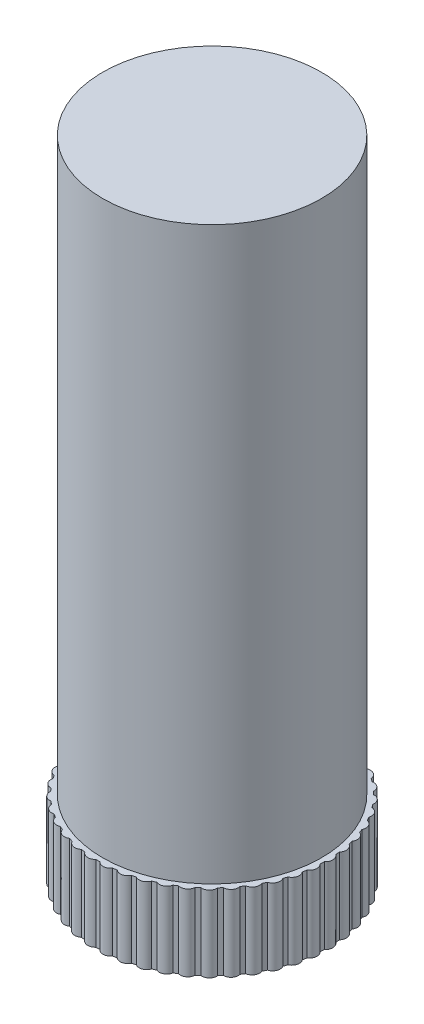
ISO-10303-21;
HEADER;
FILE_DESCRIPTION(('STEP AP214'),'2;1');
FILE_NAME('part.step','',(''),(''),'','','');
FILE_SCHEMA(('AUTOMOTIVE_DESIGN { 1 0 10303 214 1 1 1 1 }'));
ENDSEC;
DATA;
#1=APPLICATION_CONTEXT('core data for automotive mechanical design processes');
#2=APPLICATION_PROTOCOL_DEFINITION('international standard','automotive_design',2000,#1);
#3=PRODUCT_CONTEXT('',#1,'mechanical');
#4=PRODUCT('Part','Part','',(#3));
#5=PRODUCT_RELATED_PRODUCT_CATEGORY('part','',(#4));
#6=PRODUCT_DEFINITION_FORMATION('','',#4);
#7=PRODUCT_DEFINITION_CONTEXT('part definition',#1,'design');
#8=PRODUCT_DEFINITION('design','',#6,#7);
#9=PRODUCT_DEFINITION_SHAPE('','',#8);
#10=(LENGTH_UNIT() NAMED_UNIT(*) SI_UNIT(.MILLI.,.METRE.));
#11=(NAMED_UNIT(*) PLANE_ANGLE_UNIT() SI_UNIT($,.RADIAN.));
#12=(NAMED_UNIT(*) SI_UNIT($,.STERADIAN.) SOLID_ANGLE_UNIT());
#13=UNCERTAINTY_MEASURE_WITH_UNIT(LENGTH_MEASURE(1.E-05),#10,'distance_accuracy_value','');
#14=(GEOMETRIC_REPRESENTATION_CONTEXT(3) GLOBAL_UNCERTAINTY_ASSIGNED_CONTEXT((#13)) GLOBAL_UNIT_ASSIGNED_CONTEXT((#10,
#11,#12)) REPRESENTATION_CONTEXT('',''));
#15=CARTESIAN_POINT('',(0.,0.,0.));
#16=DIRECTION('',(0.,0.,1.));
#17=DIRECTION('',(1.,0.,0.));
#18=AXIS2_PLACEMENT_3D('',#15,#16,#17);
#19=CARTESIAN_POINT('',(0.,4.,0.));
#20=DIRECTION('',(0.,-1.,0.));
#21=DIRECTION('',(0.,0.,-1.));
#22=AXIS2_PLACEMENT_3D('',#19,#20,#21);
#23=CYLINDRICAL_SURFACE('',#22,6.);
#24=CARTESIAN_POINT('',(0.,0.,0.));
#25=DIRECTION('',(0.,-1.,0.));
#26=DIRECTION('',(0.,0.,-1.));
#27=AXIS2_PLACEMENT_3D('',#24,#25,#26);
#28=CIRCLE('',#27,6.);
#29=CARTESIAN_POINT('',(-0.525175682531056,0.,-5.97697168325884));
#30=VERTEX_POINT('',#29);
#31=CARTESIAN_POINT('',(-0.311768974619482,0.,-5.99189453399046));
#32=VERTEX_POINT('',#31);
#33=EDGE_CURVE('E609',#30,#32,#28,.T.);
#34=ORIENTED_EDGE('',*,*,#33,.F.);
#35=DIRECTION('',(0.,-1.,0.));
#36=VECTOR('',#35,1.);
#37=CARTESIAN_POINT('',(-0.525175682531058,2.,-5.97697168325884));
#38=LINE('',#37,#36);
#39=CARTESIAN_POINT('',(-0.525175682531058,4.,-5.97697168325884));
#40=VERTEX_POINT('',#39);
#41=EDGE_CURVE('E595',#30,#40,#38,.F.);
#42=ORIENTED_EDGE('',*,*,#41,.T.);
#43=CARTESIAN_POINT('',(0.,4.,0.));
#44=DIRECTION('',(0.,-1.,0.));
#45=DIRECTION('',(0.,0.,-1.));
#46=AXIS2_PLACEMENT_3D('',#43,#44,#45);
#47=CIRCLE('',#46,6.);
#48=CARTESIAN_POINT('',(-0.311768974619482,4.,-5.99189453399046));
#49=VERTEX_POINT('',#48);
#50=EDGE_CURVE('E607',#40,#49,#47,.T.);
#51=ORIENTED_EDGE('',*,*,#50,.T.);
#52=DIRECTION('',(0.,-1.,0.));
#53=VECTOR('',#52,1.);
#54=CARTESIAN_POINT('',(-0.311768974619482,2.,-5.99189453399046));
#55=LINE('',#54,#53);
#56=EDGE_CURVE('E632',#32,#49,#55,.F.);
#57=ORIENTED_EDGE('',*,*,#56,.F.);
#58=EDGE_LOOP('',(#34,#42,#51,#57));
#59=FACE_BOUND('',#58,.T.);
#60=ADVANCED_FACE('F37',(#59),#23,.T.);
#61=CARTESIAN_POINT('',(-1.35189839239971,4.,-5.84571387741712));
#62=VERTEX_POINT('',#61);
#63=CARTESIAN_POINT('',(-1.14264540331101,4.,-5.89019197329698));
#64=VERTEX_POINT('',#63);
#65=EDGE_CURVE('E616',#62,#64,#47,.T.);
#66=ORIENTED_EDGE('',*,*,#65,.T.);
#67=DIRECTION('',(0.,-1.,0.));
#68=VECTOR('',#67,1.);
#69=CARTESIAN_POINT('',(-1.14264540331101,2.,-5.89019197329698));
#70=LINE('',#69,#68);
#71=CARTESIAN_POINT('',(-1.14264540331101,0.,-5.89019197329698));
#72=VERTEX_POINT('',#71);
#73=EDGE_CURVE('E598',#64,#72,#70,.T.);
#74=ORIENTED_EDGE('',*,*,#73,.T.);
#75=CARTESIAN_POINT('',(-1.35189839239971,0.,-5.84571387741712));
#76=VERTEX_POINT('',#75);
#77=EDGE_CURVE('E1329',#76,#72,#28,.T.);
#78=ORIENTED_EDGE('',*,*,#77,.F.);
#79=DIRECTION('',(0.,-1.,0.));
#80=VECTOR('',#79,1.);
#81=CARTESIAN_POINT('',(-1.35189839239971,2.,-5.84571387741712));
#82=LINE('',#81,#80);
#83=EDGE_CURVE('E897',#76,#62,#82,.F.);
#84=ORIENTED_EDGE('',*,*,#83,.T.);
#85=EDGE_LOOP('',(#66,#74,#78,#84));
#86=FACE_BOUND('',#85,.T.);
#87=ADVANCED_FACE('F1295',(#86),#23,.T.);
#88=CARTESIAN_POINT('',(-2.15230793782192,4.,-5.60067590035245));
#89=VERTEX_POINT('',#88);
#90=CARTESIAN_POINT('',(-1.95128153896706,4.,-5.67384352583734));
#91=VERTEX_POINT('',#90);
#92=EDGE_CURVE('E620',#89,#91,#47,.T.);
#93=ORIENTED_EDGE('',*,*,#92,.T.);
#94=DIRECTION('',(0.,-1.,0.));
#95=VECTOR('',#94,1.);
#96=CARTESIAN_POINT('',(-1.95128153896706,2.,-5.67384352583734));
#97=LINE('',#96,#95);
#98=CARTESIAN_POINT('',(-1.95128153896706,0.,-5.67384352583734));
#99=VERTEX_POINT('',#98);
#100=EDGE_CURVE('E885',#91,#99,#97,.T.);
#101=ORIENTED_EDGE('',*,*,#100,.T.);
#102=CARTESIAN_POINT('',(-2.15230793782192,0.,-5.60067590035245));
#103=VERTEX_POINT('',#102);
#104=EDGE_CURVE('E1330',#103,#99,#28,.T.);
#105=ORIENTED_EDGE('',*,*,#104,.F.);
#106=DIRECTION('',(0.,-1.,0.));
#107=VECTOR('',#106,1.);
#108=CARTESIAN_POINT('',(-2.15230793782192,2.,-5.60067590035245));
#109=LINE('',#108,#107);
#110=EDGE_CURVE('E887',#103,#89,#109,.F.);
#111=ORIENTED_EDGE('',*,*,#110,.T.);
#112=EDGE_LOOP('',(#93,#101,#105,#111));
#113=FACE_BOUND('',#112,.T.);
#114=ADVANCED_FACE('F883',(#113),#23,.T.);
#115=CARTESIAN_POINT('',(-2.91082525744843,4.,-5.24662713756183));
#116=VERTEX_POINT('',#115);
#117=CARTESIAN_POINT('',(-2.72193819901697,4.,-5.34706016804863));
#118=VERTEX_POINT('',#117);
#119=EDGE_CURVE('E868',#116,#118,#47,.T.);
#120=ORIENTED_EDGE('',*,*,#119,.T.);
#121=DIRECTION('',(0.,-1.,0.));
#122=VECTOR('',#121,1.);
#123=CARTESIAN_POINT('',(-2.72193819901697,2.,-5.34706016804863));
#124=LINE('',#123,#122);
#125=CARTESIAN_POINT('',(-2.72193819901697,0.,-5.34706016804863));
#126=VERTEX_POINT('',#125);
#127=EDGE_CURVE('E901',#118,#126,#124,.T.);
#128=ORIENTED_EDGE('',*,*,#127,.T.);
#129=CARTESIAN_POINT('',(-2.91082525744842,0.,-5.24662713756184));
#130=VERTEX_POINT('',#129);
#131=EDGE_CURVE('E1331',#130,#126,#28,.T.);
#132=ORIENTED_EDGE('',*,*,#131,.F.);
#133=DIRECTION('',(0.,-1.,0.));
#134=VECTOR('',#133,1.);
#135=CARTESIAN_POINT('',(-2.91082525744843,2.,-5.24662713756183));
#136=LINE('',#135,#134);
#137=EDGE_CURVE('E912',#130,#116,#136,.F.);
#138=ORIENTED_EDGE('',*,*,#137,.T.);
#139=EDGE_LOOP('',(#120,#128,#132,#138));
#140=FACE_BOUND('',#139,.T.);
#141=ADVANCED_FACE('F1581',(#140),#23,.T.);
#142=CARTESIAN_POINT('',(-3.61268667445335,4.,-4.79045874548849));
#143=VERTEX_POINT('',#142);
#144=CARTESIAN_POINT('',(-3.43961542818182,4.,-4.91620236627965));
#145=VERTEX_POINT('',#144);
#146=EDGE_CURVE('E862',#143,#145,#47,.T.);
#147=ORIENTED_EDGE('',*,*,#146,.T.);
#148=DIRECTION('',(0.,-1.,0.));
#149=VECTOR('',#148,1.);
#150=CARTESIAN_POINT('',(-3.43961542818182,2.,-4.91620236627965));
#151=LINE('',#150,#149);
#152=CARTESIAN_POINT('',(-3.43961542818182,0.,-4.91620236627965));
#153=VERTEX_POINT('',#152);
#154=EDGE_CURVE('E908',#145,#153,#151,.T.);
#155=ORIENTED_EDGE('',*,*,#154,.T.);
#156=CARTESIAN_POINT('',(-3.61268667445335,0.,-4.7904587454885));
#157=VERTEX_POINT('',#156);
#158=EDGE_CURVE('E1333',#157,#153,#28,.T.);
#159=ORIENTED_EDGE('',*,*,#158,.F.);
#160=DIRECTION('',(0.,-1.,0.));
#161=VECTOR('',#160,1.);
#162=CARTESIAN_POINT('',(-3.61268667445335,2.,-4.79045874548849));
#163=LINE('',#162,#161);
#164=EDGE_CURVE('E921',#157,#143,#163,.F.);
#165=ORIENTED_EDGE('',*,*,#164,.T.);
#166=EDGE_LOOP('',(#147,#155,#159,#165));
#167=FACE_BOUND('',#166,.T.);
#168=ADVANCED_FACE('F1810',(#167),#23,.T.);
#169=CARTESIAN_POINT('',(-4.24423125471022,4.,-4.24104952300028));
#170=VERTEX_POINT('',#169);
#171=CARTESIAN_POINT('',(-4.09034445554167,4.,-4.38965627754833));
#172=VERTEX_POINT('',#171);
#173=EDGE_CURVE('E856',#170,#172,#47,.T.);
#174=ORIENTED_EDGE('',*,*,#173,.T.);
#175=DIRECTION('',(0.,-1.,0.));
#176=VECTOR('',#175,1.);
#177=CARTESIAN_POINT('',(-4.09034445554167,2.,-4.38965627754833));
#178=LINE('',#177,#176);
#179=CARTESIAN_POINT('',(-4.09034445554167,0.,-4.38965627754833));
#180=VERTEX_POINT('',#179);
#181=EDGE_CURVE('E917',#172,#180,#178,.T.);
#182=ORIENTED_EDGE('',*,*,#181,.T.);
#183=CARTESIAN_POINT('',(-4.24423125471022,0.,-4.24104952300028));
#184=VERTEX_POINT('',#183);
#185=EDGE_CURVE('E1336',#184,#180,#28,.T.);
#186=ORIENTED_EDGE('',*,*,#185,.F.);
#187=DIRECTION('',(0.,-1.,0.));
#188=VECTOR('',#187,1.);
#189=CARTESIAN_POINT('',(-4.24423125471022,2.,-4.24104952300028));
#190=LINE('',#189,#188);
#191=EDGE_CURVE('E930',#184,#170,#190,.F.);
#192=ORIENTED_EDGE('',*,*,#191,.T.);
#193=EDGE_LOOP('',(#174,#182,#186,#192));
#194=FACE_BOUND('',#193,.T.);
#195=ADVANCED_FACE('F1574',(#194),#23,.T.);
#196=CARTESIAN_POINT('',(-4.79316670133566,4.,-3.60909309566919));
#197=VERTEX_POINT('',#196);
#198=CARTESIAN_POINT('',(-4.66145958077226,4.,-3.77767052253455));
#199=VERTEX_POINT('',#198);
#200=EDGE_CURVE('E850',#197,#199,#47,.T.);
#201=ORIENTED_EDGE('',*,*,#200,.T.);
#202=DIRECTION('',(0.,-1.,0.));
#203=VECTOR('',#202,1.);
#204=CARTESIAN_POINT('',(-4.66145958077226,2.,-3.77767052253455));
#205=LINE('',#204,#203);
#206=CARTESIAN_POINT('',(-4.66145958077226,0.,-3.77767052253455));
#207=VERTEX_POINT('',#206);
#208=EDGE_CURVE('E926',#199,#207,#205,.T.);
#209=ORIENTED_EDGE('',*,*,#208,.T.);
#210=CARTESIAN_POINT('',(-4.79316670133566,0.,-3.60909309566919));
#211=VERTEX_POINT('',#210);
#212=EDGE_CURVE('E1339',#211,#207,#28,.T.);
#213=ORIENTED_EDGE('',*,*,#212,.F.);
#214=DIRECTION('',(0.,-1.,0.));
#215=VECTOR('',#214,1.);
#216=CARTESIAN_POINT('',(-4.79316670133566,2.,-3.60909309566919));
#217=LINE('',#216,#215);
#218=EDGE_CURVE('E939',#211,#197,#217,.F.);
#219=ORIENTED_EDGE('',*,*,#218,.T.);
#220=EDGE_LOOP('',(#201,#209,#213,#219));
#221=FACE_BOUND('',#220,.T.);
#222=ADVANCED_FACE('F1803',(#221),#23,.T.);
#223=CARTESIAN_POINT('',(-5.24880861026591,4.,-2.90688977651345));
#224=VERTEX_POINT('',#223);
#225=CARTESIAN_POINT('',(-5.1418446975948,4.,-3.09215670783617));
#226=VERTEX_POINT('',#225);
#227=EDGE_CURVE('E844',#224,#226,#47,.T.);
#228=ORIENTED_EDGE('',*,*,#227,.T.);
#229=DIRECTION('',(0.,-1.,0.));
#230=VECTOR('',#229,1.);
#231=CARTESIAN_POINT('',(-5.1418446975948,2.,-3.09215670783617));
#232=LINE('',#231,#230);
#233=CARTESIAN_POINT('',(-5.1418446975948,0.,-3.09215670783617));
#234=VERTEX_POINT('',#233);
#235=EDGE_CURVE('E935',#226,#234,#232,.T.);
#236=ORIENTED_EDGE('',*,*,#235,.T.);
#237=CARTESIAN_POINT('',(-5.24880861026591,0.,-2.90688977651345));
#238=VERTEX_POINT('',#237);
#239=EDGE_CURVE('E1342',#238,#234,#28,.T.);
#240=ORIENTED_EDGE('',*,*,#239,.F.);
#241=DIRECTION('',(0.,-1.,0.));
#242=VECTOR('',#241,1.);
#243=CARTESIAN_POINT('',(-5.24880861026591,2.,-2.90688977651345));
#244=LINE('',#243,#242);
#245=EDGE_CURVE('E948',#238,#224,#244,.F.);
#246=ORIENTED_EDGE('',*,*,#245,.T.);
#247=EDGE_LOOP('',(#228,#236,#240,#246));
#248=FACE_BOUND('',#247,.T.);
#249=ADVANCED_FACE('F1567',(#248),#23,.T.);
#250=CARTESIAN_POINT('',(-5.60228843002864,4.,-2.14810715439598));
#251=VERTEX_POINT('',#250);
#252=CARTESIAN_POINT('',(-5.52214965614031,4.,-2.34645758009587));
#253=VERTEX_POINT('',#252);
#254=EDGE_CURVE('E838',#251,#253,#47,.T.);
#255=ORIENTED_EDGE('',*,*,#254,.T.);
#256=DIRECTION('',(0.,-1.,0.));
#257=VECTOR('',#256,1.);
#258=CARTESIAN_POINT('',(-5.52214965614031,2.,-2.34645758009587));
#259=LINE('',#258,#257);
#260=CARTESIAN_POINT('',(-5.52214965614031,0.,-2.34645758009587));
#261=VERTEX_POINT('',#260);
#262=EDGE_CURVE('E944',#253,#261,#259,.T.);
#263=ORIENTED_EDGE('',*,*,#262,.T.);
#264=CARTESIAN_POINT('',(-5.60228843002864,0.,-2.14810715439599));
#265=VERTEX_POINT('',#264);
#266=EDGE_CURVE('E1345',#265,#261,#28,.T.);
#267=ORIENTED_EDGE('',*,*,#266,.F.);
#268=DIRECTION('',(0.,-1.,0.));
#269=VECTOR('',#268,1.);
#270=CARTESIAN_POINT('',(-5.60228843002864,2.,-2.14810715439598));
#271=LINE('',#270,#269);
#272=EDGE_CURVE('E957',#265,#251,#271,.F.);
#273=ORIENTED_EDGE('',*,*,#272,.T.);
#274=EDGE_LOOP('',(#255,#263,#267,#273));
#275=FACE_BOUND('',#274,.T.);
#276=ADVANCED_FACE('F1796',(#275),#23,.T.);
#277=CARTESIAN_POINT('',(-5.8467260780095,4.,-1.34751406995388));
#278=VERTEX_POINT('',#277);
#279=CARTESIAN_POINT('',(-5.79497225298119,4.,-1.55508732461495));
#280=VERTEX_POINT('',#279);
#281=EDGE_CURVE('E832',#278,#280,#47,.T.);
#282=ORIENTED_EDGE('',*,*,#281,.T.);
#283=DIRECTION('',(0.,-1.,0.));
#284=VECTOR('',#283,1.);
#285=CARTESIAN_POINT('',(-5.79497225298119,2.,-1.55508732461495));
#286=LINE('',#285,#284);
#287=CARTESIAN_POINT('',(-5.79497225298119,0.,-1.55508732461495));
#288=VERTEX_POINT('',#287);
#289=EDGE_CURVE('E953',#280,#288,#286,.T.);
#290=ORIENTED_EDGE('',*,*,#289,.T.);
#291=CARTESIAN_POINT('',(-5.8467260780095,0.,-1.34751406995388));
#292=VERTEX_POINT('',#291);
#293=EDGE_CURVE('E1348',#292,#288,#28,.T.);
#294=ORIENTED_EDGE('',*,*,#293,.F.);
#295=DIRECTION('',(0.,-1.,0.));
#296=VECTOR('',#295,1.);
#297=CARTESIAN_POINT('',(-5.8467260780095,2.,-1.34751406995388));
#298=LINE('',#297,#296);
#299=EDGE_CURVE('E966',#292,#278,#298,.F.);
#300=ORIENTED_EDGE('',*,*,#299,.T.);
#301=EDGE_LOOP('',(#282,#290,#294,#300));
#302=FACE_BOUND('',#301,.T.);
#303=ADVANCED_FACE('F1560',(#302),#23,.T.);
#304=CARTESIAN_POINT('',(-5.97736385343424,4.,-0.520693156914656));
#305=VERTEX_POINT('',#304);
#306=CARTESIAN_POINT('',(-5.95500230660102,4.,-0.733449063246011));
#307=VERTEX_POINT('',#306);
#308=EDGE_CURVE('E826',#305,#307,#47,.T.);
#309=ORIENTED_EDGE('',*,*,#308,.T.);
#310=DIRECTION('',(0.,-1.,0.));
#311=VECTOR('',#310,1.);
#312=CARTESIAN_POINT('',(-5.95500230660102,2.,-0.733449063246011));
#313=LINE('',#312,#311);
#314=CARTESIAN_POINT('',(-5.95500230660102,0.,-0.733449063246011));
#315=VERTEX_POINT('',#314);
#316=EDGE_CURVE('E962',#307,#315,#313,.T.);
#317=ORIENTED_EDGE('',*,*,#316,.T.);
#318=CARTESIAN_POINT('',(-5.97736385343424,0.,-0.520693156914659));
#319=VERTEX_POINT('',#318);
#320=EDGE_CURVE('E1351',#319,#315,#28,.T.);
#321=ORIENTED_EDGE('',*,*,#320,.F.);
#322=DIRECTION('',(0.,-1.,0.));
#323=VECTOR('',#322,1.);
#324=CARTESIAN_POINT('',(-5.97736385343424,2.,-0.520693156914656));
#325=LINE('',#324,#323);
#326=EDGE_CURVE('E975',#319,#305,#325,.F.);
#327=ORIENTED_EDGE('',*,*,#326,.T.);
#328=EDGE_LOOP('',(#309,#317,#321,#327));
#329=FACE_BOUND('',#328,.T.);
#330=ADVANCED_FACE('F1789',(#329),#23,.T.);
#331=CARTESIAN_POINT('',(-5.99165904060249,4.,0.316262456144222));
#332=VERTEX_POINT('',#331);
#333=CARTESIAN_POINT('',(-5.9991250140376,4.,0.102464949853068));
#334=VERTEX_POINT('',#333);
#335=EDGE_CURVE('E820',#332,#334,#47,.T.);
#336=ORIENTED_EDGE('',*,*,#335,.T.);
#337=DIRECTION('',(0.,-1.,0.));
#338=VECTOR('',#337,1.);
#339=CARTESIAN_POINT('',(-5.9991250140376,2.,0.102464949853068));
#340=LINE('',#339,#338);
#341=CARTESIAN_POINT('',(-5.9991250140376,0.,0.102464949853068));
#342=VERTEX_POINT('',#341);
#343=EDGE_CURVE('E971',#334,#342,#340,.T.);
#344=ORIENTED_EDGE('',*,*,#343,.T.);
#345=CARTESIAN_POINT('',(-5.9916590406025,0.,0.31626245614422));
#346=VERTEX_POINT('',#345);
#347=EDGE_CURVE('E1354',#346,#342,#28,.T.);
#348=ORIENTED_EDGE('',*,*,#347,.F.);
#349=DIRECTION('',(0.,-1.,0.));
#350=VECTOR('',#349,1.);
#351=CARTESIAN_POINT('',(-5.99165904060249,2.,0.316262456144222));
#352=LINE('',#351,#350);
#353=EDGE_CURVE('E984',#346,#332,#352,.F.);
#354=ORIENTED_EDGE('',*,*,#353,.T.);
#355=EDGE_LOOP('',(#336,#344,#348,#354));
#356=FACE_BOUND('',#355,.T.);
#357=ADVANCED_FACE('F1553',(#356),#23,.T.);
#358=CARTESIAN_POINT('',(-5.88933339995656,4.,1.14706238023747));
#359=VERTEX_POINT('',#358);
#360=CARTESIAN_POINT('',(-5.92648157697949,4.,0.93638459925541));
#361=VERTEX_POINT('',#360);
#362=EDGE_CURVE('E814',#359,#361,#47,.T.);
#363=ORIENTED_EDGE('',*,*,#362,.T.);
#364=DIRECTION('',(0.,-1.,0.));
#365=VECTOR('',#364,1.);
#366=CARTESIAN_POINT('',(-5.92648157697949,2.,0.93638459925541));
#367=LINE('',#366,#365);
#368=CARTESIAN_POINT('',(-5.92648157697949,0.,0.93638459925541));
#369=VERTEX_POINT('',#368);
#370=EDGE_CURVE('E980',#361,#369,#367,.T.);
#371=ORIENTED_EDGE('',*,*,#370,.T.);
#372=CARTESIAN_POINT('',(-5.88933339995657,0.,1.14706238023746));
#373=VERTEX_POINT('',#372);
#374=EDGE_CURVE('E1357',#373,#369,#28,.T.);
#375=ORIENTED_EDGE('',*,*,#374,.F.);
#376=DIRECTION('',(0.,-1.,0.));
#377=VECTOR('',#376,1.);
#378=CARTESIAN_POINT('',(-5.88933339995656,2.,1.14706238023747));
#379=LINE('',#378,#377);
#380=EDGE_CURVE('E993',#373,#359,#379,.F.);
#381=ORIENTED_EDGE('',*,*,#380,.T.);
#382=EDGE_LOOP('',(#363,#371,#375,#381));
#383=FACE_BOUND('',#382,.T.);
#384=ADVANCED_FACE('F1782',(#383),#23,.T.);
#385=CARTESIAN_POINT('',(-5.67237858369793,4.,1.95553603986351));
#386=VERTEX_POINT('',#385);
#387=CARTESIAN_POINT('',(-5.73848591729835,4.,1.75207858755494));
#388=VERTEX_POINT('',#387);
#389=EDGE_CURVE('E808',#386,#388,#47,.T.);
#390=ORIENTED_EDGE('',*,*,#389,.T.);
#391=DIRECTION('',(0.,-1.,0.));
#392=VECTOR('',#391,1.);
#393=CARTESIAN_POINT('',(-5.73848591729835,2.,1.75207858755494));
#394=LINE('',#393,#392);
#395=CARTESIAN_POINT('',(-5.73848591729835,0.,1.75207858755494));
#396=VERTEX_POINT('',#395);
#397=EDGE_CURVE('E989',#388,#396,#394,.T.);
#398=ORIENTED_EDGE('',*,*,#397,.T.);
#399=CARTESIAN_POINT('',(-5.67237858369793,0.,1.9555360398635));
#400=VERTEX_POINT('',#399);
#401=EDGE_CURVE('E1360',#400,#396,#28,.T.);
#402=ORIENTED_EDGE('',*,*,#401,.F.);
#403=DIRECTION('',(0.,-1.,0.));
#404=VECTOR('',#403,1.);
#405=CARTESIAN_POINT('',(-5.67237858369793,2.,1.95553603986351));
#406=LINE('',#405,#404);
#407=EDGE_CURVE('E1002',#400,#386,#406,.F.);
#408=ORIENTED_EDGE('',*,*,#407,.T.);
#409=EDGE_LOOP('',(#390,#398,#402,#408));
#410=FACE_BOUND('',#409,.T.);
#411=ADVANCED_FACE('F1546',(#410),#23,.T.);
#412=CARTESIAN_POINT('',(-5.34501737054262,4.,2.72594741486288));
#413=VERTEX_POINT('',#412);
#414=CARTESIAN_POINT('',(-5.43879715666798,4.,2.53367035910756));
#415=VERTEX_POINT('',#414);
#416=EDGE_CURVE('E802',#413,#415,#47,.T.);
#417=ORIENTED_EDGE('',*,*,#416,.T.);
#418=DIRECTION('',(0.,-1.,0.));
#419=VECTOR('',#418,1.);
#420=CARTESIAN_POINT('',(-5.43879715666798,2.,2.53367035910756));
#421=LINE('',#420,#419);
#422=CARTESIAN_POINT('',(-5.43879715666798,0.,2.53367035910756));
#423=VERTEX_POINT('',#422);
#424=EDGE_CURVE('E998',#415,#423,#421,.T.);
#425=ORIENTED_EDGE('',*,*,#424,.T.);
#426=CARTESIAN_POINT('',(-5.34501737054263,0.,2.72594741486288));
#427=VERTEX_POINT('',#426);
#428=EDGE_CURVE('E1363',#427,#423,#28,.T.);
#429=ORIENTED_EDGE('',*,*,#428,.F.);
#430=DIRECTION('',(0.,-1.,0.));
#431=VECTOR('',#430,1.);
#432=CARTESIAN_POINT('',(-5.34501737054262,2.,2.72594741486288));
#433=LINE('',#432,#431);
#434=EDGE_CURVE('E1011',#427,#413,#433,.F.);
#435=ORIENTED_EDGE('',*,*,#434,.T.);
#436=EDGE_LOOP('',(#417,#425,#429,#435));
#437=FACE_BOUND('',#436,.T.);
#438=ADVANCED_FACE('F1775',(#437),#23,.T.);
#439=CARTESIAN_POINT('',(-4.91362147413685,4.,3.44330132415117));
#440=VERTEX_POINT('',#439);
#441=CARTESIAN_POINT('',(-5.03324839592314,4.,3.26594711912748));
#442=VERTEX_POINT('',#441);
#443=EDGE_CURVE('E796',#440,#442,#47,.T.);
#444=ORIENTED_EDGE('',*,*,#443,.T.);
#445=DIRECTION('',(0.,-1.,0.));
#446=VECTOR('',#445,1.);
#447=CARTESIAN_POINT('',(-5.03324839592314,2.,3.26594711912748));
#448=LINE('',#447,#446);
#449=CARTESIAN_POINT('',(-5.03324839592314,0.,3.26594711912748));
#450=VERTEX_POINT('',#449);
#451=EDGE_CURVE('E1007',#442,#450,#448,.T.);
#452=ORIENTED_EDGE('',*,*,#451,.T.);
#453=CARTESIAN_POINT('',(-4.91362147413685,0.,3.44330132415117));
#454=VERTEX_POINT('',#453);
#455=EDGE_CURVE('E1366',#454,#450,#28,.T.);
#456=ORIENTED_EDGE('',*,*,#455,.F.);
#457=DIRECTION('',(0.,-1.,0.));
#458=VECTOR('',#457,1.);
#459=CARTESIAN_POINT('',(-4.91362147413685,2.,3.44330132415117));
#460=LINE('',#459,#458);
#461=EDGE_CURVE('E1020',#454,#440,#460,.F.);
#462=ORIENTED_EDGE('',*,*,#461,.T.);
#463=EDGE_LOOP('',(#444,#452,#456,#462));
#464=FACE_BOUND('',#463,.T.);
#465=ADVANCED_FACE('F1539',(#464),#23,.T.);
#466=CARTESIAN_POINT('',(-4.38658752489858,4.,4.09363528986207));
#467=VERTEX_POINT('',#466);
#468=CARTESIAN_POINT('',(-4.52973318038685,4.,3.93465593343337));
#469=VERTEX_POINT('',#468);
#470=EDGE_CURVE('E790',#467,#469,#47,.T.);
#471=ORIENTED_EDGE('',*,*,#470,.T.);
#472=DIRECTION('',(0.,-1.,0.));
#473=VECTOR('',#472,1.);
#474=CARTESIAN_POINT('',(-4.52973318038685,2.,3.93465593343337));
#475=LINE('',#474,#473);
#476=CARTESIAN_POINT('',(-4.52973318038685,0.,3.93465593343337));
#477=VERTEX_POINT('',#476);
#478=EDGE_CURVE('E1016',#469,#477,#475,.T.);
#479=ORIENTED_EDGE('',*,*,#478,.T.);
#480=CARTESIAN_POINT('',(-4.38658752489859,0.,4.09363528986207));
#481=VERTEX_POINT('',#480);
#482=EDGE_CURVE('E1369',#481,#477,#28,.T.);
#483=ORIENTED_EDGE('',*,*,#482,.F.);
#484=DIRECTION('',(0.,-1.,0.));
#485=VECTOR('',#484,1.);
#486=CARTESIAN_POINT('',(-4.38658752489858,2.,4.09363528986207));
#487=LINE('',#486,#485);
#488=EDGE_CURVE('E1029',#481,#467,#487,.F.);
#489=ORIENTED_EDGE('',*,*,#488,.T.);
#490=EDGE_LOOP('',(#471,#479,#483,#489));
#491=FACE_BOUND('',#490,.T.);
#492=ADVANCED_FACE('F1768',(#491),#23,.T.);
#493=CARTESIAN_POINT('',(-3.77417363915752,4.,4.66429130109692));
#494=VERTEX_POINT('',#493);
#495=CARTESIAN_POINT('',(-3.93805186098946,4.,4.52678114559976));
#496=VERTEX_POINT('',#495);
#497=EDGE_CURVE('E784',#494,#496,#47,.T.);
#498=ORIENTED_EDGE('',*,*,#497,.T.);
#499=DIRECTION('',(0.,-1.,0.));
#500=VECTOR('',#499,1.);
#501=CARTESIAN_POINT('',(-3.93805186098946,2.,4.52678114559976));
#502=LINE('',#501,#500);
#503=CARTESIAN_POINT('',(-3.93805186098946,0.,4.52678114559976));
#504=VERTEX_POINT('',#503);
#505=EDGE_CURVE('E1025',#496,#504,#502,.T.);
#506=ORIENTED_EDGE('',*,*,#505,.T.);
#507=CARTESIAN_POINT('',(-3.77417363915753,0.,4.66429130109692));
#508=VERTEX_POINT('',#507);
#509=EDGE_CURVE('E1372',#508,#504,#28,.T.);
#510=ORIENTED_EDGE('',*,*,#509,.F.);
#511=DIRECTION('',(0.,-1.,0.));
#512=VECTOR('',#511,1.);
#513=CARTESIAN_POINT('',(-3.77417363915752,2.,4.66429130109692));
#514=LINE('',#513,#512);
#515=EDGE_CURVE('E1038',#508,#494,#514,.F.);
#516=ORIENTED_EDGE('',*,*,#515,.T.);
#517=EDGE_LOOP('',(#498,#506,#510,#516));
#518=FACE_BOUND('',#517,.T.);
#519=ADVANCED_FACE('F1532',(#518),#23,.T.);
#520=CARTESIAN_POINT('',(-3.08829975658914,4.,5.14416218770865));
#521=VERTEX_POINT('',#520);
#522=CARTESIAN_POINT('',(-3.2697208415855,4.,5.03079771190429));
#523=VERTEX_POINT('',#522);
#524=EDGE_CURVE('E778',#521,#523,#47,.T.);
#525=ORIENTED_EDGE('',*,*,#524,.T.);
#526=DIRECTION('',(0.,-1.,0.));
#527=VECTOR('',#526,1.);
#528=CARTESIAN_POINT('',(-3.2697208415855,2.,5.03079771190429));
#529=LINE('',#528,#527);
#530=CARTESIAN_POINT('',(-3.2697208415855,0.,5.03079771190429));
#531=VERTEX_POINT('',#530);
#532=EDGE_CURVE('E1034',#523,#531,#529,.T.);
#533=ORIENTED_EDGE('',*,*,#532,.T.);
#534=CARTESIAN_POINT('',(-3.08829975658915,0.,5.14416218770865));
#535=VERTEX_POINT('',#534);
#536=EDGE_CURVE('E1375',#535,#531,#28,.T.);
#537=ORIENTED_EDGE('',*,*,#536,.F.);
#538=DIRECTION('',(0.,-1.,0.));
#539=VECTOR('',#538,1.);
#540=CARTESIAN_POINT('',(-3.08829975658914,2.,5.14416218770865));
#541=LINE('',#540,#539);
#542=EDGE_CURVE('E1047',#535,#521,#541,.F.);
#543=ORIENTED_EDGE('',*,*,#542,.T.);
#544=EDGE_LOOP('',(#525,#533,#537,#543));
#545=FACE_BOUND('',#544,.T.);
#546=ADVANCED_FACE('F1761',(#545),#23,.T.);
#547=CARTESIAN_POINT('',(-2.34231563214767,4.,5.52390780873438));
#548=VERTEX_POINT('',#547);
#549=CARTESIAN_POINT('',(-2.53774842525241,4.,5.43689552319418));
#550=VERTEX_POINT('',#549);
#551=EDGE_CURVE('E772',#548,#550,#47,.T.);
#552=ORIENTED_EDGE('',*,*,#551,.T.);
#553=DIRECTION('',(0.,-1.,0.));
#554=VECTOR('',#553,1.);
#555=CARTESIAN_POINT('',(-2.53774842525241,2.,5.43689552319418));
#556=LINE('',#555,#554);
#557=CARTESIAN_POINT('',(-2.53774842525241,0.,5.43689552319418));
#558=VERTEX_POINT('',#557);
#559=EDGE_CURVE('E1043',#550,#558,#556,.T.);
#560=ORIENTED_EDGE('',*,*,#559,.T.);
#561=CARTESIAN_POINT('',(-2.34231563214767,0.,5.52390780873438));
#562=VERTEX_POINT('',#561);
#563=EDGE_CURVE('E1378',#562,#558,#28,.T.);
#564=ORIENTED_EDGE('',*,*,#563,.F.);
#565=DIRECTION('',(0.,-1.,0.));
#566=VECTOR('',#565,1.);
#567=CARTESIAN_POINT('',(-2.34231563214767,2.,5.52390780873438));
#568=LINE('',#567,#566);
#569=EDGE_CURVE('E1056',#562,#548,#568,.F.);
#570=ORIENTED_EDGE('',*,*,#569,.T.);
#571=EDGE_LOOP('',(#552,#560,#564,#570));
#572=FACE_BOUND('',#571,.T.);
#573=ADVANCED_FACE('F1525',(#572),#23,.T.);
#574=CARTESIAN_POINT('',(-1.55074099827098,4.,5.7961368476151));
#575=VERTEX_POINT('',#574);
#576=CARTESIAN_POINT('',(-1.75638162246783,4.,5.73717034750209));
#577=VERTEX_POINT('',#576);
#578=EDGE_CURVE('E766',#575,#577,#47,.T.);
#579=ORIENTED_EDGE('',*,*,#578,.T.);
#580=DIRECTION('',(0.,-1.,0.));
#581=VECTOR('',#580,1.);
#582=CARTESIAN_POINT('',(-1.75638162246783,2.,5.73717034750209));
#583=LINE('',#582,#581);
#584=CARTESIAN_POINT('',(-1.75638162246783,0.,5.73717034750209));
#585=VERTEX_POINT('',#584);
#586=EDGE_CURVE('E1052',#577,#585,#583,.T.);
#587=ORIENTED_EDGE('',*,*,#586,.T.);
#588=CARTESIAN_POINT('',(-1.55074099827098,0.,5.7961368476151));
#589=VERTEX_POINT('',#588);
#590=EDGE_CURVE('E1381',#589,#585,#28,.T.);
#591=ORIENTED_EDGE('',*,*,#590,.F.);
#592=DIRECTION('',(0.,-1.,0.));
#593=VECTOR('',#592,1.);
#594=CARTESIAN_POINT('',(-1.55074099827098,2.,5.7961368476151));
#595=LINE('',#594,#593);
#596=EDGE_CURVE('E1065',#589,#575,#595,.F.);
#597=ORIENTED_EDGE('',*,*,#596,.T.);
#598=EDGE_LOOP('',(#579,#587,#591,#597));
#599=FACE_BOUND('',#598,.T.);
#600=ADVANCED_FACE('F1754',(#599),#23,.T.);
#601=CARTESIAN_POINT('',(-0.72898295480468,4.,5.95555067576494));
#602=VERTEX_POINT('',#601);
#603=CARTESIAN_POINT('',(-0.940828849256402,4.,5.92577767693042));
#604=VERTEX_POINT('',#603);
#605=EDGE_CURVE('E760',#602,#604,#47,.T.);
#606=ORIENTED_EDGE('',*,*,#605,.T.);
#607=DIRECTION('',(0.,-1.,0.));
#608=VECTOR('',#607,1.);
#609=CARTESIAN_POINT('',(-0.940828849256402,2.,5.92577767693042));
#610=LINE('',#609,#608);
#611=CARTESIAN_POINT('',(-0.940828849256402,0.,5.92577767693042));
#612=VERTEX_POINT('',#611);
#613=EDGE_CURVE('E1061',#604,#612,#610,.T.);
#614=ORIENTED_EDGE('',*,*,#613,.T.);
#615=CARTESIAN_POINT('',(-0.728982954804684,0.,5.95555067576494));
#616=VERTEX_POINT('',#615);
#617=EDGE_CURVE('E1384',#616,#612,#28,.T.);
#618=ORIENTED_EDGE('',*,*,#617,.F.);
#619=DIRECTION('',(0.,-1.,0.));
#620=VECTOR('',#619,1.);
#621=CARTESIAN_POINT('',(-0.72898295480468,2.,5.95555067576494));
#622=LINE('',#621,#620);
#623=EDGE_CURVE('E1074',#616,#602,#622,.F.);
#624=ORIENTED_EDGE('',*,*,#623,.T.);
#625=EDGE_LOOP('',(#606,#614,#618,#624));
#626=FACE_BOUND('',#625,.T.);
#627=ADVANCED_FACE('F1518',(#626),#23,.T.);
#628=CARTESIAN_POINT('',(0.106963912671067,4.,5.9990464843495));
#629=VERTEX_POINT('',#628);
#630=CARTESIAN_POINT('',(-0.106963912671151,4.,5.9990464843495));
#631=VERTEX_POINT('',#630);
#632=EDGE_CURVE('E754',#629,#631,#47,.T.);
#633=ORIENTED_EDGE('',*,*,#632,.T.);
#634=DIRECTION('',(0.,-1.,0.));
#635=VECTOR('',#634,1.);
#636=CARTESIAN_POINT('',(-0.10696391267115,2.,5.9990464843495));
#637=LINE('',#636,#635);
#638=CARTESIAN_POINT('',(-0.106963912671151,0.,5.9990464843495));
#639=VERTEX_POINT('',#638);
#640=EDGE_CURVE('E1070',#631,#639,#637,.T.);
#641=ORIENTED_EDGE('',*,*,#640,.T.);
#642=CARTESIAN_POINT('',(0.106963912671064,0.,5.9990464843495));
#643=VERTEX_POINT('',#642);
#644=EDGE_CURVE('E1387',#643,#639,#28,.T.);
#645=ORIENTED_EDGE('',*,*,#644,.F.);
#646=DIRECTION('',(0.,-1.,0.));
#647=VECTOR('',#646,1.);
#648=CARTESIAN_POINT('',(0.106963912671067,2.,5.9990464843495));
#649=LINE('',#648,#647);
#650=EDGE_CURVE('E1083',#643,#629,#649,.F.);
#651=ORIENTED_EDGE('',*,*,#650,.T.);
#652=EDGE_LOOP('',(#633,#641,#645,#651));
#653=FACE_BOUND('',#652,.T.);
#654=ADVANCED_FACE('F1747',(#653),#23,.T.);
#655=CARTESIAN_POINT('',(0.940828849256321,4.,5.92577767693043));
#656=VERTEX_POINT('',#655);
#657=CARTESIAN_POINT('',(0.728982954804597,4.,5.95555067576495));
#658=VERTEX_POINT('',#657);
#659=EDGE_CURVE('E748',#656,#658,#47,.T.);
#660=ORIENTED_EDGE('',*,*,#659,.T.);
#661=DIRECTION('',(0.,-1.,0.));
#662=VECTOR('',#661,1.);
#663=CARTESIAN_POINT('',(0.728982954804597,2.,5.95555067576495));
#664=LINE('',#663,#662);
#665=CARTESIAN_POINT('',(0.728982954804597,0.,5.95555067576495));
#666=VERTEX_POINT('',#665);
#667=EDGE_CURVE('E1079',#658,#666,#664,.T.);
#668=ORIENTED_EDGE('',*,*,#667,.T.);
#669=CARTESIAN_POINT('',(0.940828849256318,0.,5.92577767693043));
#670=VERTEX_POINT('',#669);
#671=EDGE_CURVE('E1390',#670,#666,#28,.T.);
#672=ORIENTED_EDGE('',*,*,#671,.F.);
#673=DIRECTION('',(0.,-1.,0.));
#674=VECTOR('',#673,1.);
#675=CARTESIAN_POINT('',(0.940828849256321,2.,5.92577767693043));
#676=LINE('',#675,#674);
#677=EDGE_CURVE('E1092',#670,#656,#676,.F.);
#678=ORIENTED_EDGE('',*,*,#677,.T.);
#679=EDGE_LOOP('',(#660,#668,#672,#678));
#680=FACE_BOUND('',#679,.T.);
#681=ADVANCED_FACE('F1511',(#680),#23,.T.);
#682=CARTESIAN_POINT('',(1.75638162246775,4.,5.73717034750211));
#683=VERTEX_POINT('',#682);
#684=CARTESIAN_POINT('',(1.5507409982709,4.,5.79613684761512));
#685=VERTEX_POINT('',#684);
#686=EDGE_CURVE('E742',#683,#685,#47,.T.);
#687=ORIENTED_EDGE('',*,*,#686,.T.);
#688=DIRECTION('',(0.,-1.,0.));
#689=VECTOR('',#688,1.);
#690=CARTESIAN_POINT('',(1.5507409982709,2.,5.79613684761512));
#691=LINE('',#690,#689);
#692=CARTESIAN_POINT('',(1.5507409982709,0.,5.79613684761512));
#693=VERTEX_POINT('',#692);
#694=EDGE_CURVE('E1088',#685,#693,#691,.T.);
#695=ORIENTED_EDGE('',*,*,#694,.T.);
#696=CARTESIAN_POINT('',(1.75638162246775,0.,5.73717034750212));
#697=VERTEX_POINT('',#696);
#698=EDGE_CURVE('E1393',#697,#693,#28,.T.);
#699=ORIENTED_EDGE('',*,*,#698,.F.);
#700=DIRECTION('',(0.,-1.,0.));
#701=VECTOR('',#700,1.);
#702=CARTESIAN_POINT('',(1.75638162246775,2.,5.73717034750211));
#703=LINE('',#702,#701);
#704=EDGE_CURVE('E1101',#697,#683,#703,.F.);
#705=ORIENTED_EDGE('',*,*,#704,.T.);
#706=EDGE_LOOP('',(#687,#695,#699,#705));
#707=FACE_BOUND('',#706,.T.);
#708=ADVANCED_FACE('F1740',(#707),#23,.T.);
#709=CARTESIAN_POINT('',(2.53774842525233,4.,5.43689552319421));
#710=VERTEX_POINT('',#709);
#711=CARTESIAN_POINT('',(2.34231563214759,4.,5.52390780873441));
#712=VERTEX_POINT('',#711);
#713=EDGE_CURVE('E736',#710,#712,#47,.T.);
#714=ORIENTED_EDGE('',*,*,#713,.T.);
#715=DIRECTION('',(0.,-1.,0.));
#716=VECTOR('',#715,1.);
#717=CARTESIAN_POINT('',(2.34231563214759,2.,5.52390780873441));
#718=LINE('',#717,#716);
#719=CARTESIAN_POINT('',(2.34231563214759,0.,5.52390780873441));
#720=VERTEX_POINT('',#719);
#721=EDGE_CURVE('E1097',#712,#720,#718,.T.);
#722=ORIENTED_EDGE('',*,*,#721,.T.);
#723=CARTESIAN_POINT('',(2.53774842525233,0.,5.43689552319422));
#724=VERTEX_POINT('',#723);
#725=EDGE_CURVE('E1396',#724,#720,#28,.T.);
#726=ORIENTED_EDGE('',*,*,#725,.F.);
#727=DIRECTION('',(0.,-1.,0.));
#728=VECTOR('',#727,1.);
#729=CARTESIAN_POINT('',(2.53774842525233,2.,5.43689552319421));
#730=LINE('',#729,#728);
#731=EDGE_CURVE('E1110',#724,#710,#730,.F.);
#732=ORIENTED_EDGE('',*,*,#731,.T.);
#733=EDGE_LOOP('',(#714,#722,#726,#732));
#734=FACE_BOUND('',#733,.T.);
#735=ADVANCED_FACE('F1504',(#734),#23,.T.);
#736=CARTESIAN_POINT('',(3.26972084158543,4.,5.03079771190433));
#737=VERTEX_POINT('',#736);
#738=CARTESIAN_POINT('',(3.08829975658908,4.,5.14416218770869));
#739=VERTEX_POINT('',#738);
#740=EDGE_CURVE('E730',#737,#739,#47,.T.);
#741=ORIENTED_EDGE('',*,*,#740,.T.);
#742=DIRECTION('',(0.,-1.,0.));
#743=VECTOR('',#742,1.);
#744=CARTESIAN_POINT('',(3.08829975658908,2.,5.14416218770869));
#745=LINE('',#744,#743);
#746=CARTESIAN_POINT('',(3.08829975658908,0.,5.14416218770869));
#747=VERTEX_POINT('',#746);
#748=EDGE_CURVE('E1106',#739,#747,#745,.T.);
#749=ORIENTED_EDGE('',*,*,#748,.T.);
#750=CARTESIAN_POINT('',(3.26972084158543,0.,5.03079771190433));
#751=VERTEX_POINT('',#750);
#752=EDGE_CURVE('E1399',#751,#747,#28,.T.);
#753=ORIENTED_EDGE('',*,*,#752,.F.);
#754=DIRECTION('',(0.,-1.,0.));
#755=VECTOR('',#754,1.);
#756=CARTESIAN_POINT('',(3.26972084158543,2.,5.03079771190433));
#757=LINE('',#756,#755);
#758=EDGE_CURVE('E1119',#751,#737,#757,.F.);
#759=ORIENTED_EDGE('',*,*,#758,.T.);
#760=EDGE_LOOP('',(#741,#749,#753,#759));
#761=FACE_BOUND('',#760,.T.);
#762=ADVANCED_FACE('F1733',(#761),#23,.T.);
#763=CARTESIAN_POINT('',(3.93805186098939,4.,4.52678114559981));
#764=VERTEX_POINT('',#763);
#765=CARTESIAN_POINT('',(3.77417363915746,4.,4.66429130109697));
#766=VERTEX_POINT('',#765);
#767=EDGE_CURVE('E724',#764,#766,#47,.T.);
#768=ORIENTED_EDGE('',*,*,#767,.T.);
#769=DIRECTION('',(0.,-1.,0.));
#770=VECTOR('',#769,1.);
#771=CARTESIAN_POINT('',(3.77417363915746,2.,4.66429130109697));
#772=LINE('',#771,#770);
#773=CARTESIAN_POINT('',(3.77417363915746,0.,4.66429130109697));
#774=VERTEX_POINT('',#773);
#775=EDGE_CURVE('E1115',#766,#774,#772,.T.);
#776=ORIENTED_EDGE('',*,*,#775,.T.);
#777=CARTESIAN_POINT('',(3.93805186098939,0.,4.52678114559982));
#778=VERTEX_POINT('',#777);
#779=EDGE_CURVE('E1402',#778,#774,#28,.T.);
#780=ORIENTED_EDGE('',*,*,#779,.F.);
#781=DIRECTION('',(0.,-1.,0.));
#782=VECTOR('',#781,1.);
#783=CARTESIAN_POINT('',(3.93805186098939,2.,4.52678114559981));
#784=LINE('',#783,#782);
#785=EDGE_CURVE('E1128',#778,#764,#784,.F.);
#786=ORIENTED_EDGE('',*,*,#785,.T.);
#787=EDGE_LOOP('',(#768,#776,#780,#786));
#788=FACE_BOUND('',#787,.T.);
#789=ADVANCED_FACE('F1497',(#788),#23,.T.);
#790=CARTESIAN_POINT('',(4.5297331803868,4.,3.93465593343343));
#791=VERTEX_POINT('',#790);
#792=CARTESIAN_POINT('',(4.38658752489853,4.,4.09363528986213));
#793=VERTEX_POINT('',#792);
#794=EDGE_CURVE('E718',#791,#793,#47,.T.);
#795=ORIENTED_EDGE('',*,*,#794,.T.);
#796=DIRECTION('',(0.,-1.,0.));
#797=VECTOR('',#796,1.);
#798=CARTESIAN_POINT('',(4.38658752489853,2.,4.09363528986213));
#799=LINE('',#798,#797);
#800=CARTESIAN_POINT('',(4.38658752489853,0.,4.09363528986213));
#801=VERTEX_POINT('',#800);
#802=EDGE_CURVE('E1124',#793,#801,#799,.T.);
#803=ORIENTED_EDGE('',*,*,#802,.T.);
#804=CARTESIAN_POINT('',(4.5297331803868,0.,3.93465593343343));
#805=VERTEX_POINT('',#804);
#806=EDGE_CURVE('E1405',#805,#801,#28,.T.);
#807=ORIENTED_EDGE('',*,*,#806,.F.);
#808=DIRECTION('',(0.,-1.,0.));
#809=VECTOR('',#808,1.);
#810=CARTESIAN_POINT('',(4.5297331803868,2.,3.93465593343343));
#811=LINE('',#810,#809);
#812=EDGE_CURVE('E1137',#805,#791,#811,.F.);
#813=ORIENTED_EDGE('',*,*,#812,.T.);
#814=EDGE_LOOP('',(#795,#803,#807,#813));
#815=FACE_BOUND('',#814,.T.);
#816=ADVANCED_FACE('F1726',(#815),#23,.T.);
#817=CARTESIAN_POINT('',(5.0332483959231,4.,3.26594711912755));
#818=VERTEX_POINT('',#817);
#819=CARTESIAN_POINT('',(4.9136214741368,4.,3.44330132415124));
#820=VERTEX_POINT('',#819);
#821=EDGE_CURVE('E712',#818,#820,#47,.T.);
#822=ORIENTED_EDGE('',*,*,#821,.T.);
#823=DIRECTION('',(0.,-1.,0.));
#824=VECTOR('',#823,1.);
#825=CARTESIAN_POINT('',(4.9136214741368,2.,3.44330132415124));
#826=LINE('',#825,#824);
#827=CARTESIAN_POINT('',(4.9136214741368,0.,3.44330132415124));
#828=VERTEX_POINT('',#827);
#829=EDGE_CURVE('E1133',#820,#828,#826,.T.);
#830=ORIENTED_EDGE('',*,*,#829,.T.);
#831=CARTESIAN_POINT('',(5.0332483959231,0.,3.26594711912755));
#832=VERTEX_POINT('',#831);
#833=EDGE_CURVE('E1408',#832,#828,#28,.T.);
#834=ORIENTED_EDGE('',*,*,#833,.F.);
#835=DIRECTION('',(0.,-1.,0.));
#836=VECTOR('',#835,1.);
#837=CARTESIAN_POINT('',(5.0332483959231,2.,3.26594711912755));
#838=LINE('',#837,#836);
#839=EDGE_CURVE('E1146',#832,#818,#838,.F.);
#840=ORIENTED_EDGE('',*,*,#839,.T.);
#841=EDGE_LOOP('',(#822,#830,#834,#840));
#842=FACE_BOUND('',#841,.T.);
#843=ADVANCED_FACE('F1490',(#842),#23,.T.);
#844=CARTESIAN_POINT('',(5.43879715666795,4.,2.53367035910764));
#845=VERTEX_POINT('',#844);
#846=CARTESIAN_POINT('',(5.34501737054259,4.,2.72594741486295));
#847=VERTEX_POINT('',#846);
#848=EDGE_CURVE('E706',#845,#847,#47,.T.);
#849=ORIENTED_EDGE('',*,*,#848,.T.);
#850=DIRECTION('',(0.,-1.,0.));
#851=VECTOR('',#850,1.);
#852=CARTESIAN_POINT('',(5.34501737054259,2.,2.72594741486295));
#853=LINE('',#852,#851);
#854=CARTESIAN_POINT('',(5.34501737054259,0.,2.72594741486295));
#855=VERTEX_POINT('',#854);
#856=EDGE_CURVE('E1142',#847,#855,#853,.T.);
#857=ORIENTED_EDGE('',*,*,#856,.T.);
#858=CARTESIAN_POINT('',(5.43879715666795,0.,2.53367035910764));
#859=VERTEX_POINT('',#858);
#860=EDGE_CURVE('E1411',#859,#855,#28,.T.);
#861=ORIENTED_EDGE('',*,*,#860,.F.);
#862=DIRECTION('',(0.,-1.,0.));
#863=VECTOR('',#862,1.);
#864=CARTESIAN_POINT('',(5.43879715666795,2.,2.53367035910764));
#865=LINE('',#864,#863);
#866=EDGE_CURVE('E1155',#859,#845,#865,.F.);
#867=ORIENTED_EDGE('',*,*,#866,.T.);
#868=EDGE_LOOP('',(#849,#857,#861,#867));
#869=FACE_BOUND('',#868,.T.);
#870=ADVANCED_FACE('F1719',(#869),#23,.T.);
#871=CARTESIAN_POINT('',(5.73848591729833,4.,1.75207858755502));
#872=VERTEX_POINT('',#871);
#873=CARTESIAN_POINT('',(5.6723785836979,4.,1.95553603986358));
#874=VERTEX_POINT('',#873);
#875=EDGE_CURVE('E700',#872,#874,#47,.T.);
#876=ORIENTED_EDGE('',*,*,#875,.T.);
#877=DIRECTION('',(0.,-1.,0.));
#878=VECTOR('',#877,1.);
#879=CARTESIAN_POINT('',(5.6723785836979,2.,1.95553603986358));
#880=LINE('',#879,#878);
#881=CARTESIAN_POINT('',(5.6723785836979,0.,1.95553603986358));
#882=VERTEX_POINT('',#881);
#883=EDGE_CURVE('E1151',#874,#882,#880,.T.);
#884=ORIENTED_EDGE('',*,*,#883,.T.);
#885=CARTESIAN_POINT('',(5.73848591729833,0.,1.75207858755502));
#886=VERTEX_POINT('',#885);
#887=EDGE_CURVE('E1414',#886,#882,#28,.T.);
#888=ORIENTED_EDGE('',*,*,#887,.F.);
#889=DIRECTION('',(0.,-1.,0.));
#890=VECTOR('',#889,1.);
#891=CARTESIAN_POINT('',(5.73848591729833,2.,1.75207858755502));
#892=LINE('',#891,#890);
#893=EDGE_CURVE('E1164',#886,#872,#892,.F.);
#894=ORIENTED_EDGE('',*,*,#893,.T.);
#895=EDGE_LOOP('',(#876,#884,#888,#894));
#896=FACE_BOUND('',#895,.T.);
#897=ADVANCED_FACE('F1483',(#896),#23,.T.);
#898=CARTESIAN_POINT('',(5.92648157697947,4.,0.936384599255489));
#899=VERTEX_POINT('',#898);
#900=CARTESIAN_POINT('',(5.88933339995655,4.,1.14706238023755));
#901=VERTEX_POINT('',#900);
#902=EDGE_CURVE('E694',#899,#901,#47,.T.);
#903=ORIENTED_EDGE('',*,*,#902,.T.);
#904=DIRECTION('',(0.,-1.,0.));
#905=VECTOR('',#904,1.);
#906=CARTESIAN_POINT('',(5.88933339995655,2.,1.14706238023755));
#907=LINE('',#906,#905);
#908=CARTESIAN_POINT('',(5.88933339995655,0.,1.14706238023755));
#909=VERTEX_POINT('',#908);
#910=EDGE_CURVE('E1160',#901,#909,#907,.T.);
#911=ORIENTED_EDGE('',*,*,#910,.T.);
#912=CARTESIAN_POINT('',(5.92648157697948,0.,0.936384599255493));
#913=VERTEX_POINT('',#912);
#914=EDGE_CURVE('E1417',#913,#909,#28,.T.);
#915=ORIENTED_EDGE('',*,*,#914,.F.);
#916=DIRECTION('',(0.,-1.,0.));
#917=VECTOR('',#916,1.);
#918=CARTESIAN_POINT('',(5.92648157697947,2.,0.936384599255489));
#919=LINE('',#918,#917);
#920=EDGE_CURVE('E1173',#913,#899,#919,.F.);
#921=ORIENTED_EDGE('',*,*,#920,.T.);
#922=EDGE_LOOP('',(#903,#911,#915,#921));
#923=FACE_BOUND('',#922,.T.);
#924=ADVANCED_FACE('F1712',(#923),#23,.T.);
#925=CARTESIAN_POINT('',(5.9991250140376,4.,0.10246494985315));
#926=VERTEX_POINT('',#925);
#927=CARTESIAN_POINT('',(5.99165904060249,4.,0.316262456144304));
#928=VERTEX_POINT('',#927);
#929=EDGE_CURVE('E688',#926,#928,#47,.T.);
#930=ORIENTED_EDGE('',*,*,#929,.T.);
#931=DIRECTION('',(0.,-1.,0.));
#932=VECTOR('',#931,1.);
#933=CARTESIAN_POINT('',(5.99165904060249,2.,0.316262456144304));
#934=LINE('',#933,#932);
#935=CARTESIAN_POINT('',(5.99165904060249,0.,0.316262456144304));
#936=VERTEX_POINT('',#935);
#937=EDGE_CURVE('E1169',#928,#936,#934,.T.);
#938=ORIENTED_EDGE('',*,*,#937,.T.);
#939=CARTESIAN_POINT('',(5.9991250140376,0.,0.102464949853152));
#940=VERTEX_POINT('',#939);
#941=EDGE_CURVE('E1420',#940,#936,#28,.T.);
#942=ORIENTED_EDGE('',*,*,#941,.F.);
#943=DIRECTION('',(0.,-1.,0.));
#944=VECTOR('',#943,1.);
#945=CARTESIAN_POINT('',(5.9991250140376,2.,0.10246494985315));
#946=LINE('',#945,#944);
#947=EDGE_CURVE('E1182',#940,#926,#946,.F.);
#948=ORIENTED_EDGE('',*,*,#947,.T.);
#949=EDGE_LOOP('',(#930,#938,#942,#948));
#950=FACE_BOUND('',#949,.T.);
#951=ADVANCED_FACE('F1476',(#950),#23,.T.);
#952=CARTESIAN_POINT('',(5.95500230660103,4.,-0.73344906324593));
#953=VERTEX_POINT('',#952);
#954=CARTESIAN_POINT('',(5.97736385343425,4.,-0.520693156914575));
#955=VERTEX_POINT('',#954);
#956=EDGE_CURVE('E682',#953,#955,#47,.T.);
#957=ORIENTED_EDGE('',*,*,#956,.T.);
#958=DIRECTION('',(0.,-1.,0.));
#959=VECTOR('',#958,1.);
#960=CARTESIAN_POINT('',(5.97736385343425,2.,-0.520693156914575));
#961=LINE('',#960,#959);
#962=CARTESIAN_POINT('',(5.97736385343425,0.,-0.520693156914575));
#963=VERTEX_POINT('',#962);
#964=EDGE_CURVE('E1178',#955,#963,#961,.T.);
#965=ORIENTED_EDGE('',*,*,#964,.T.);
#966=CARTESIAN_POINT('',(5.95500230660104,0.,-0.733449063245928));
#967=VERTEX_POINT('',#966);
#968=EDGE_CURVE('E1423',#967,#963,#28,.T.);
#969=ORIENTED_EDGE('',*,*,#968,.F.);
#970=DIRECTION('',(0.,-1.,0.));
#971=VECTOR('',#970,1.);
#972=CARTESIAN_POINT('',(5.95500230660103,2.,-0.73344906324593));
#973=LINE('',#972,#971);
#974=EDGE_CURVE('E1191',#967,#953,#973,.F.);
#975=ORIENTED_EDGE('',*,*,#974,.T.);
#976=EDGE_LOOP('',(#957,#965,#969,#975));
#977=FACE_BOUND('',#976,.T.);
#978=ADVANCED_FACE('F1705',(#977),#23,.T.);
#979=CARTESIAN_POINT('',(5.79497225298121,4.,-1.55508732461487));
#980=VERTEX_POINT('',#979);
#981=CARTESIAN_POINT('',(5.84672607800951,4.,-1.3475140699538));
#982=VERTEX_POINT('',#981);
#983=EDGE_CURVE('E676',#980,#982,#47,.T.);
#984=ORIENTED_EDGE('',*,*,#983,.T.);
#985=DIRECTION('',(0.,-1.,0.));
#986=VECTOR('',#985,1.);
#987=CARTESIAN_POINT('',(5.84672607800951,2.,-1.3475140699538));
#988=LINE('',#987,#986);
#989=CARTESIAN_POINT('',(5.84672607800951,0.,-1.3475140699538));
#990=VERTEX_POINT('',#989);
#991=EDGE_CURVE('E1187',#982,#990,#988,.T.);
#992=ORIENTED_EDGE('',*,*,#991,.T.);
#993=CARTESIAN_POINT('',(5.79497225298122,0.,-1.55508732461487));
#994=VERTEX_POINT('',#993);
#995=EDGE_CURVE('E1426',#994,#990,#28,.T.);
#996=ORIENTED_EDGE('',*,*,#995,.F.);
#997=DIRECTION('',(0.,-1.,0.));
#998=VECTOR('',#997,1.);
#999=CARTESIAN_POINT('',(5.79497225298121,2.,-1.55508732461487));
#1000=LINE('',#999,#998);
#1001=EDGE_CURVE('E1200',#994,#980,#1000,.F.);
#1002=ORIENTED_EDGE('',*,*,#1001,.T.);
#1003=EDGE_LOOP('',(#984,#992,#996,#1002));
#1004=FACE_BOUND('',#1003,.T.);
#1005=ADVANCED_FACE('F1469',(#1004),#23,.T.);
#1006=CARTESIAN_POINT('',(5.52214965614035,4.,-2.3464575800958));
#1007=VERTEX_POINT('',#1006);
#1008=CARTESIAN_POINT('',(5.60228843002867,4.,-2.14810715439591));
#1009=VERTEX_POINT('',#1008);
#1010=EDGE_CURVE('E670',#1007,#1009,#47,.T.);
#1011=ORIENTED_EDGE('',*,*,#1010,.T.);
#1012=DIRECTION('',(0.,-1.,0.));
#1013=VECTOR('',#1012,1.);
#1014=CARTESIAN_POINT('',(5.60228843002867,2.,-2.14810715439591));
#1015=LINE('',#1014,#1013);
#1016=CARTESIAN_POINT('',(5.60228843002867,0.,-2.14810715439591));
#1017=VERTEX_POINT('',#1016);
#1018=EDGE_CURVE('E1196',#1009,#1017,#1015,.T.);
#1019=ORIENTED_EDGE('',*,*,#1018,.T.);
#1020=CARTESIAN_POINT('',(5.52214965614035,0.,-2.3464575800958));
#1021=VERTEX_POINT('',#1020);
#1022=EDGE_CURVE('E1429',#1021,#1017,#28,.T.);
#1023=ORIENTED_EDGE('',*,*,#1022,.F.);
#1024=DIRECTION('',(0.,-1.,0.));
#1025=VECTOR('',#1024,1.);
#1026=CARTESIAN_POINT('',(5.52214965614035,2.,-2.3464575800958));
#1027=LINE('',#1026,#1025);
#1028=EDGE_CURVE('E1209',#1021,#1007,#1027,.F.);
#1029=ORIENTED_EDGE('',*,*,#1028,.T.);
#1030=EDGE_LOOP('',(#1011,#1019,#1023,#1029));
#1031=FACE_BOUND('',#1030,.T.);
#1032=ADVANCED_FACE('F1698',(#1031),#23,.T.);
#1033=CARTESIAN_POINT('',(5.14184469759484,4.,-3.0921567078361));
#1034=VERTEX_POINT('',#1033);
#1035=CARTESIAN_POINT('',(5.24880861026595,4.,-2.90688977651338));
#1036=VERTEX_POINT('',#1035);
#1037=EDGE_CURVE('E664',#1034,#1036,#47,.T.);
#1038=ORIENTED_EDGE('',*,*,#1037,.T.);
#1039=DIRECTION('',(0.,-1.,0.));
#1040=VECTOR('',#1039,1.);
#1041=CARTESIAN_POINT('',(5.24880861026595,2.,-2.90688977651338));
#1042=LINE('',#1041,#1040);
#1043=CARTESIAN_POINT('',(5.24880861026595,0.,-2.90688977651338));
#1044=VERTEX_POINT('',#1043);
#1045=EDGE_CURVE('E1205',#1036,#1044,#1042,.T.);
#1046=ORIENTED_EDGE('',*,*,#1045,.T.);
#1047=CARTESIAN_POINT('',(5.14184469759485,0.,-3.0921567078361));
#1048=VERTEX_POINT('',#1047);
#1049=EDGE_CURVE('E1432',#1048,#1044,#28,.T.);
#1050=ORIENTED_EDGE('',*,*,#1049,.F.);
#1051=DIRECTION('',(0.,-1.,0.));
#1052=VECTOR('',#1051,1.);
#1053=CARTESIAN_POINT('',(5.14184469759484,2.,-3.0921567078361));
#1054=LINE('',#1053,#1052);
#1055=EDGE_CURVE('E1218',#1048,#1034,#1054,.F.);
#1056=ORIENTED_EDGE('',*,*,#1055,.T.);
#1057=EDGE_LOOP('',(#1038,#1046,#1050,#1056));
#1058=FACE_BOUND('',#1057,.T.);
#1059=ADVANCED_FACE('F1462',(#1058),#23,.T.);
#1060=CARTESIAN_POINT('',(4.66145958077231,4.,-3.77767052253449));
#1061=VERTEX_POINT('',#1060);
#1062=CARTESIAN_POINT('',(4.79316670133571,4.,-3.60909309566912));
#1063=VERTEX_POINT('',#1062);
#1064=EDGE_CURVE('E658',#1061,#1063,#47,.T.);
#1065=ORIENTED_EDGE('',*,*,#1064,.T.);
#1066=DIRECTION('',(0.,-1.,0.));
#1067=VECTOR('',#1066,1.);
#1068=CARTESIAN_POINT('',(4.79316670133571,2.,-3.60909309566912));
#1069=LINE('',#1068,#1067);
#1070=CARTESIAN_POINT('',(4.79316670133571,0.,-3.60909309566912));
#1071=VERTEX_POINT('',#1070);
#1072=EDGE_CURVE('E1214',#1063,#1071,#1069,.T.);
#1073=ORIENTED_EDGE('',*,*,#1072,.T.);
#1074=CARTESIAN_POINT('',(4.66145958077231,0.,-3.77767052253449));
#1075=VERTEX_POINT('',#1074);
#1076=EDGE_CURVE('E1435',#1075,#1071,#28,.T.);
#1077=ORIENTED_EDGE('',*,*,#1076,.F.);
#1078=DIRECTION('',(0.,-1.,0.));
#1079=VECTOR('',#1078,1.);
#1080=CARTESIAN_POINT('',(4.66145958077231,2.,-3.77767052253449));
#1081=LINE('',#1080,#1079);
#1082=EDGE_CURVE('E1227',#1075,#1061,#1081,.F.);
#1083=ORIENTED_EDGE('',*,*,#1082,.T.);
#1084=EDGE_LOOP('',(#1065,#1073,#1077,#1083));
#1085=FACE_BOUND('',#1084,.T.);
#1086=ADVANCED_FACE('F1691',(#1085),#23,.T.);
#1087=CARTESIAN_POINT('',(4.09034445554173,4.,-4.38965627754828));
#1088=VERTEX_POINT('',#1087);
#1089=CARTESIAN_POINT('',(4.24423125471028,4.,-4.24104952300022));
#1090=VERTEX_POINT('',#1089);
#1091=EDGE_CURVE('E652',#1088,#1090,#47,.T.);
#1092=ORIENTED_EDGE('',*,*,#1091,.T.);
#1093=DIRECTION('',(0.,-1.,0.));
#1094=VECTOR('',#1093,1.);
#1095=CARTESIAN_POINT('',(4.24423125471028,2.,-4.24104952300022));
#1096=LINE('',#1095,#1094);
#1097=CARTESIAN_POINT('',(4.24423125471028,0.,-4.24104952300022));
#1098=VERTEX_POINT('',#1097);
#1099=EDGE_CURVE('E1223',#1090,#1098,#1096,.T.);
#1100=ORIENTED_EDGE('',*,*,#1099,.T.);
#1101=CARTESIAN_POINT('',(4.09034445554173,0.,-4.38965627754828));
#1102=VERTEX_POINT('',#1101);
#1103=EDGE_CURVE('E1438',#1102,#1098,#28,.T.);
#1104=ORIENTED_EDGE('',*,*,#1103,.F.);
#1105=DIRECTION('',(0.,-1.,0.));
#1106=VECTOR('',#1105,1.);
#1107=CARTESIAN_POINT('',(4.09034445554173,2.,-4.38965627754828));
#1108=LINE('',#1107,#1106);
#1109=EDGE_CURVE('E1236',#1102,#1088,#1108,.F.);
#1110=ORIENTED_EDGE('',*,*,#1109,.T.);
#1111=EDGE_LOOP('',(#1092,#1100,#1104,#1110));
#1112=FACE_BOUND('',#1111,.T.);
#1113=ADVANCED_FACE('F1455',(#1112),#23,.T.);
#1114=CARTESIAN_POINT('',(3.43961542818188,4.,-4.9162023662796));
#1115=VERTEX_POINT('',#1114);
#1116=CARTESIAN_POINT('',(3.61268667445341,4.,-4.79045874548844));
#1117=VERTEX_POINT('',#1116);
#1118=EDGE_CURVE('E646',#1115,#1117,#47,.T.);
#1119=ORIENTED_EDGE('',*,*,#1118,.T.);
#1120=DIRECTION('',(0.,-1.,0.));
#1121=VECTOR('',#1120,1.);
#1122=CARTESIAN_POINT('',(3.61268667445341,2.,-4.79045874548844));
#1123=LINE('',#1122,#1121);
#1124=CARTESIAN_POINT('',(3.61268667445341,0.,-4.79045874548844));
#1125=VERTEX_POINT('',#1124);
#1126=EDGE_CURVE('E1232',#1117,#1125,#1123,.T.);
#1127=ORIENTED_EDGE('',*,*,#1126,.T.);
#1128=CARTESIAN_POINT('',(3.43961542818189,0.,-4.9162023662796));
#1129=VERTEX_POINT('',#1128);
#1130=EDGE_CURVE('E1441',#1129,#1125,#28,.T.);
#1131=ORIENTED_EDGE('',*,*,#1130,.F.);
#1132=DIRECTION('',(0.,-1.,0.));
#1133=VECTOR('',#1132,1.);
#1134=CARTESIAN_POINT('',(3.43961542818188,2.,-4.9162023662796));
#1135=LINE('',#1134,#1133);
#1136=EDGE_CURVE('E1245',#1129,#1115,#1135,.F.);
#1137=ORIENTED_EDGE('',*,*,#1136,.T.);
#1138=EDGE_LOOP('',(#1119,#1127,#1131,#1137));
#1139=FACE_BOUND('',#1138,.T.);
#1140=ADVANCED_FACE('F1684',(#1139),#23,.T.);
#1141=CARTESIAN_POINT('',(2.72193819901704,4.,-5.34706016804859));
#1142=VERTEX_POINT('',#1141);
#1143=CARTESIAN_POINT('',(2.9108252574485,4.,-5.24662713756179));
#1144=VERTEX_POINT('',#1143);
#1145=EDGE_CURVE('E640',#1142,#1144,#47,.T.);
#1146=ORIENTED_EDGE('',*,*,#1145,.T.);
#1147=DIRECTION('',(0.,-1.,0.));
#1148=VECTOR('',#1147,1.);
#1149=CARTESIAN_POINT('',(2.9108252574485,2.,-5.24662713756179));
#1150=LINE('',#1149,#1148);
#1151=CARTESIAN_POINT('',(2.9108252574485,0.,-5.24662713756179));
#1152=VERTEX_POINT('',#1151);
#1153=EDGE_CURVE('E1241',#1144,#1152,#1150,.T.);
#1154=ORIENTED_EDGE('',*,*,#1153,.T.);
#1155=CARTESIAN_POINT('',(2.72193819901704,0.,-5.34706016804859));
#1156=VERTEX_POINT('',#1155);
#1157=EDGE_CURVE('E1276',#1156,#1152,#28,.T.);
#1158=ORIENTED_EDGE('',*,*,#1157,.F.);
#1159=DIRECTION('',(0.,-1.,0.));
#1160=VECTOR('',#1159,1.);
#1161=CARTESIAN_POINT('',(2.72193819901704,2.,-5.34706016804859));
#1162=LINE('',#1161,#1160);
#1163=EDGE_CURVE('E1254',#1156,#1142,#1162,.F.);
#1164=ORIENTED_EDGE('',*,*,#1163,.T.);
#1165=EDGE_LOOP('',(#1146,#1154,#1158,#1164));
#1166=FACE_BOUND('',#1165,.T.);
#1167=ADVANCED_FACE('F1449',(#1166),#23,.T.);
#1168=CARTESIAN_POINT('',(1.95128153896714,4.,-5.67384352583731));
#1169=VERTEX_POINT('',#1168);
#1170=CARTESIAN_POINT('',(2.152307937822,4.,-5.60067590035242));
#1171=VERTEX_POINT('',#1170);
#1172=EDGE_CURVE('E635',#1169,#1171,#47,.T.);
#1173=ORIENTED_EDGE('',*,*,#1172,.T.);
#1174=DIRECTION('',(0.,-1.,0.));
#1175=VECTOR('',#1174,1.);
#1176=CARTESIAN_POINT('',(2.152307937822,2.,-5.60067590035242));
#1177=LINE('',#1176,#1175);
#1178=CARTESIAN_POINT('',(2.152307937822,0.,-5.60067590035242));
#1179=VERTEX_POINT('',#1178);
#1180=EDGE_CURVE('E1250',#1171,#1179,#1177,.T.);
#1181=ORIENTED_EDGE('',*,*,#1180,.T.);
#1182=CARTESIAN_POINT('',(1.95128153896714,0.,-5.67384352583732));
#1183=VERTEX_POINT('',#1182);
#1184=EDGE_CURVE('E1274',#1183,#1179,#28,.T.);
#1185=ORIENTED_EDGE('',*,*,#1184,.F.);
#1186=DIRECTION('',(0.,-1.,0.));
#1187=VECTOR('',#1186,1.);
#1188=CARTESIAN_POINT('',(1.95128153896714,2.,-5.67384352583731));
#1189=LINE('',#1188,#1187);
#1190=EDGE_CURVE('E1263',#1183,#1169,#1189,.F.);
#1191=ORIENTED_EDGE('',*,*,#1190,.T.);
#1192=EDGE_LOOP('',(#1173,#1181,#1185,#1191));
#1193=FACE_BOUND('',#1192,.T.);
#1194=ADVANCED_FACE('F1678',(#1193),#23,.T.);
#1195=CARTESIAN_POINT('',(1.14264540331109,4.,-5.89019197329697));
#1196=VERTEX_POINT('',#1195);
#1197=CARTESIAN_POINT('',(1.35189839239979,4.,-5.8457138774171));
#1198=VERTEX_POINT('',#1197);
#1199=EDGE_CURVE('E627',#1196,#1198,#47,.T.);
#1200=ORIENTED_EDGE('',*,*,#1199,.T.);
#1201=DIRECTION('',(0.,-1.,0.));
#1202=VECTOR('',#1201,1.);
#1203=CARTESIAN_POINT('',(1.35189839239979,2.,-5.8457138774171));
#1204=LINE('',#1203,#1202);
#1205=CARTESIAN_POINT('',(1.35189839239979,0.,-5.8457138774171));
#1206=VERTEX_POINT('',#1205);
#1207=EDGE_CURVE('E1259',#1198,#1206,#1204,.T.);
#1208=ORIENTED_EDGE('',*,*,#1207,.T.);
#1209=CARTESIAN_POINT('',(1.14264540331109,0.,-5.89019197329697));
#1210=VERTEX_POINT('',#1209);
#1211=EDGE_CURVE('E622',#1210,#1206,#28,.T.);
#1212=ORIENTED_EDGE('',*,*,#1211,.F.);
#1213=DIRECTION('',(0.,-1.,0.));
#1214=VECTOR('',#1213,1.);
#1215=CARTESIAN_POINT('',(1.1426454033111,2.,-5.89019197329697));
#1216=LINE('',#1215,#1214);
#1217=EDGE_CURVE('E11',#1210,#1196,#1216,.F.);
#1218=ORIENTED_EDGE('',*,*,#1217,.T.);
#1219=EDGE_LOOP('',(#1200,#1208,#1212,#1218));
#1220=FACE_BOUND('',#1219,.T.);
#1221=ADVANCED_FACE('F1272',(#1220),#23,.T.);
#1222=CARTESIAN_POINT('',(0.311768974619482,4.,-5.99189453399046));
#1223=VERTEX_POINT('',#1222);
#1224=CARTESIAN_POINT('',(0.525175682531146,4.,-5.97697168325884));
#1225=VERTEX_POINT('',#1224);
#1226=EDGE_CURVE('E619',#1223,#1225,#47,.T.);
#1227=ORIENTED_EDGE('',*,*,#1226,.T.);
#1228=DIRECTION('',(0.,-1.,0.));
#1229=VECTOR('',#1228,1.);
#1230=CARTESIAN_POINT('',(0.525175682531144,2.,-5.97697168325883));
#1231=LINE('',#1230,#1229);
#1232=CARTESIAN_POINT('',(0.525175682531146,0.,-5.97697168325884));
#1233=VERTEX_POINT('',#1232);
#1234=EDGE_CURVE('E45',#1225,#1233,#1231,.T.);
#1235=ORIENTED_EDGE('',*,*,#1234,.T.);
#1236=CARTESIAN_POINT('',(0.311768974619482,0.,-5.99189453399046));
#1237=VERTEX_POINT('',#1236);
#1238=EDGE_CURVE('E617',#1237,#1233,#28,.T.);
#1239=ORIENTED_EDGE('',*,*,#1238,.F.);
#1240=DIRECTION('',(0.,-1.,0.));
#1241=VECTOR('',#1240,1.);
#1242=CARTESIAN_POINT('',(0.311768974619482,2.,-5.99189453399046));
#1243=LINE('',#1242,#1241);
#1244=EDGE_CURVE('E626',#1223,#1237,#1243,.T.);
#1245=ORIENTED_EDGE('',*,*,#1244,.F.);
#1246=EDGE_LOOP('',(#1227,#1235,#1239,#1245));
#1247=FACE_BOUND('',#1246,.T.);
#1248=ADVANCED_FACE('F1283',(#1247),#23,.T.);
#1249=CARTESIAN_POINT('',(0.,4.,-5.75));
#1250=DIRECTION('',(0.,-1.,0.));
#1251=DIRECTION('',(0.,0.,-1.));
#1252=AXIS2_PLACEMENT_3D('',#1249,#1250,#1251);
#1253=CYLINDRICAL_SURFACE('',#1252,0.394604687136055);
#1254=CARTESIAN_POINT('',(0.,0.,-5.75));
#1255=DIRECTION('',(0.,1.,0.));
#1256=DIRECTION('',(0.,0.,1.));
#1257=AXIS2_PLACEMENT_3D('',#1254,#1255,#1256);
#1258=CIRCLE('',#1257,0.394604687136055);
#1259=EDGE_CURVE('E1279',#1237,#32,#1258,.T.);
#1260=ORIENTED_EDGE('',*,*,#1259,.T.);
#1261=ORIENTED_EDGE('',*,*,#56,.T.);
#1262=CARTESIAN_POINT('',(0.,4.,-5.75));
#1263=DIRECTION('',(0.,1.,0.));
#1264=DIRECTION('',(0.,0.,1.));
#1265=AXIS2_PLACEMENT_3D('',#1262,#1263,#1264);
#1266=CIRCLE('',#1265,0.394604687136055);
#1267=EDGE_CURVE('E615',#1223,#49,#1266,.T.);
#1268=ORIENTED_EDGE('',*,*,#1267,.F.);
#1269=ORIENTED_EDGE('',*,*,#1244,.T.);
#1270=EDGE_LOOP('',(#1260,#1261,#1268,#1269));
#1271=FACE_BOUND('',#1270,.T.);
#1272=ADVANCED_FACE('F39',(#1271),#1253,.T.);
#1273=CARTESIAN_POINT('',(0.,4.,-5.75));
#1274=DIRECTION('',(0.,1.,0.));
#1275=DIRECTION('',(0.,0.,1.));
#1276=AXIS2_PLACEMENT_3D('',#1273,#1274,#1275);
#1277=PLANE('',#1276);
#1278=CARTESIAN_POINT('',(0.,4.,0.));
#1279=DIRECTION('',(0.,1.,0.));
#1280=DIRECTION('',(0.,0.,1.));
#1281=AXIS2_PLACEMENT_3D('',#1278,#1279,#1280);
#1282=CIRCLE('',#1281,5.75);
#1283=CARTESIAN_POINT('',(0.,4.,5.75));
#1284=VERTEX_POINT('',#1283);
#1285=EDGE_CURVE('E1316',#1284,#1284,#1282,.T.);
#1286=ORIENTED_EDGE('',*,*,#1285,.F.);
#1287=EDGE_LOOP('',(#1286));
#1288=FACE_BOUND('',#1287,.T.);
#1289=ORIENTED_EDGE('',*,*,#50,.F.);
#1290=CARTESIAN_POINT('',(-0.800245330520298,4.,-5.69404139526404));
#1291=DIRECTION('',(0.,1.,0.));
#1292=DIRECTION('',(0.,0.,1.));
#1293=AXIS2_PLACEMENT_3D('',#1290,#1291,#1292);
#1294=CIRCLE('',#1293,0.394604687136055);
#1295=EDGE_CURVE('E592',#40,#64,#1294,.T.);
#1296=ORIENTED_EDGE('',*,*,#1295,.T.);
#1297=ORIENTED_EDGE('',*,*,#65,.F.);
#1298=CARTESIAN_POINT('',(-1.58491479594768,4.,-5.52725475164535));
#1299=DIRECTION('',(0.,1.,0.));
#1300=DIRECTION('',(0.,0.,1.));
#1301=AXIS2_PLACEMENT_3D('',#1298,#1299,#1300);
#1302=CIRCLE('',#1301,0.394604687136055);
#1303=EDGE_CURVE('E610',#62,#91,#1302,.T.);
#1304=ORIENTED_EDGE('',*,*,#1303,.T.);
#1305=ORIENTED_EDGE('',*,*,#92,.F.);
#1306=CARTESIAN_POINT('',(-2.33873569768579,4.,-5.25288638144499));
#1307=DIRECTION('',(0.,1.,0.));
#1308=DIRECTION('',(0.,0.,1.));
#1309=AXIS2_PLACEMENT_3D('',#1306,#1307,#1308);
#1310=CIRCLE('',#1309,0.394604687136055);
#1311=EDGE_CURVE('E890',#89,#118,#1310,.T.);
#1312=ORIENTED_EDGE('',*,*,#1311,.T.);
#1313=ORIENTED_EDGE('',*,*,#119,.F.);
#1314=CARTESIAN_POINT('',(-3.04703576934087,4.,-4.87627655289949));
#1315=DIRECTION('',(0.,1.,0.));
#1316=DIRECTION('',(0.,0.,1.));
#1317=AXIS2_PLACEMENT_3D('',#1314,#1315,#1316);
#1318=CIRCLE('',#1317,0.394604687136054);
#1319=EDGE_CURVE('E905',#116,#145,#1318,.T.);
#1320=ORIENTED_EDGE('',*,*,#1319,.T.);
#1321=ORIENTED_EDGE('',*,*,#146,.F.);
#1322=CARTESIAN_POINT('',(-3.69602875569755,4.,-4.40475554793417));
#1323=DIRECTION('',(0.,1.,0.));
#1324=DIRECTION('',(0.,0.,1.));
#1325=AXIS2_PLACEMENT_3D('',#1322,#1323,#1324);
#1326=CIRCLE('',#1325,0.394604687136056);
#1327=EDGE_CURVE('E914',#143,#172,#1326,.T.);
#1328=ORIENTED_EDGE('',*,*,#1327,.T.);
#1329=ORIENTED_EDGE('',*,*,#173,.F.);
#1330=CARTESIAN_POINT('',(-4.27308274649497,4.,-3.84750098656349));
#1331=DIRECTION('',(0.,1.,0.));
#1332=DIRECTION('',(0.,0.,1.));
#1333=AXIS2_PLACEMENT_3D('',#1330,#1331,#1332);
#1334=CIRCLE('',#1333,0.394604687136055);
#1335=EDGE_CURVE('E923',#170,#199,#1334,.T.);
#1336=ORIENTED_EDGE('',*,*,#1335,.T.);
#1337=ORIENTED_EDGE('',*,*,#200,.F.);
#1338=CARTESIAN_POINT('',(-4.76696604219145,4.,-3.21535919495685));
#1339=DIRECTION('',(0.,1.,0.));
#1340=DIRECTION('',(0.,0.,1.));
#1341=AXIS2_PLACEMENT_3D('',#1338,#1339,#1340);
#1342=CIRCLE('',#1341,0.394604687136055);
#1343=EDGE_CURVE('E932',#197,#226,#1342,.T.);
#1344=ORIENTED_EDGE('',*,*,#1343,.T.);
#1345=ORIENTED_EDGE('',*,*,#227,.F.);
#1346=CARTESIAN_POINT('',(-5.16806576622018,4.,-2.52063409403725));
#1347=DIRECTION('',(0.,1.,0.));
#1348=DIRECTION('',(0.,0.,1.));
#1349=AXIS2_PLACEMENT_3D('',#1346,#1347,#1348);
#1350=CIRCLE('',#1349,0.394604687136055);
#1351=EDGE_CURVE('E941',#224,#253,#1350,.T.);
#1352=ORIENTED_EDGE('',*,*,#1351,.T.);
#1353=ORIENTED_EDGE('',*,*,#254,.F.);
#1354=CARTESIAN_POINT('',(-5.46857496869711,4.,-1.776847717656));
#1355=DIRECTION('',(0.,1.,0.));
#1356=DIRECTION('',(0.,0.,1.));
#1357=AXIS2_PLACEMENT_3D('',#1354,#1355,#1356);
#1358=CIRCLE('',#1357,0.394604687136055);
#1359=EDGE_CURVE('E950',#251,#280,#1358,.T.);
#1360=ORIENTED_EDGE('',*,*,#1359,.T.);
#1361=ORIENTED_EDGE('',*,*,#281,.F.);
#1362=CARTESIAN_POINT('',(-5.66264457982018,4.,-0.998477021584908));
#1363=DIRECTION('',(0.,1.,0.));
#1364=DIRECTION('',(0.,0.,1.));
#1365=AXIS2_PLACEMENT_3D('',#1362,#1363,#1364);
#1366=CIRCLE('',#1365,0.394604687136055);
#1367=EDGE_CURVE('E959',#278,#307,#1366,.T.);
#1368=ORIENTED_EDGE('',*,*,#1367,.T.);
#1369=ORIENTED_EDGE('',*,*,#308,.F.);
#1370=CARTESIAN_POINT('',(-5.7464972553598,4.,-0.200672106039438));
#1371=DIRECTION('',(0.,1.,0.));
#1372=DIRECTION('',(0.,0.,1.));
#1373=AXIS2_PLACEMENT_3D('',#1370,#1371,#1372);
#1374=CIRCLE('',#1373,0.394604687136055);
#1375=EDGE_CURVE('E968',#305,#334,#1374,.T.);
#1376=ORIENTED_EDGE('',*,*,#1375,.T.);
#1377=ORIENTED_EDGE('',*,*,#335,.F.);
#1378=CARTESIAN_POINT('',(-5.71850089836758,4.,0.601038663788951));
#1379=DIRECTION('',(0.,1.,0.));
#1380=DIRECTION('',(0.,0.,1.));
#1381=AXIS2_PLACEMENT_3D('',#1378,#1379,#1380);
#1382=CIRCLE('',#1381,0.394604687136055);
#1383=EDGE_CURVE('E977',#332,#361,#1382,.T.);
#1384=ORIENTED_EDGE('',*,*,#1383,.T.);
#1385=ORIENTED_EDGE('',*,*,#362,.F.);
#1386=CARTESIAN_POINT('',(-5.57920042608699,4.,1.39105089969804));
#1387=DIRECTION('',(0.,1.,0.));
#1388=DIRECTION('',(0.,0.,1.));
#1389=AXIS2_PLACEMENT_3D('',#1386,#1387,#1388);
#1390=CIRCLE('',#1389,0.394604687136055);
#1391=EDGE_CURVE('E986',#359,#388,#1390,.T.);
#1392=ORIENTED_EDGE('',*,*,#1391,.T.);
#1393=ORIENTED_EDGE('',*,*,#389,.F.);
#1394=CARTESIAN_POINT('',(-5.33130716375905,4.,2.15398791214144));
#1395=DIRECTION('',(0.,1.,0.));
#1396=DIRECTION('',(0.,0.,1.));
#1397=AXIS2_PLACEMENT_3D('',#1394,#1395,#1396);
#1398=CIRCLE('',#1397,0.394604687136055);
#1399=EDGE_CURVE('E995',#386,#415,#1398,.T.);
#1400=ORIENTED_EDGE('',*,*,#1399,.T.);
#1401=ORIENTED_EDGE('',*,*,#416,.F.);
#1402=CARTESIAN_POINT('',(-4.97964607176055,4.,2.87499999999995));
#1403=DIRECTION('',(0.,1.,0.));
#1404=DIRECTION('',(0.,0.,1.));
#1405=AXIS2_PLACEMENT_3D('',#1402,#1403,#1404);
#1406=CIRCLE('',#1405,0.394604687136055);
#1407=EDGE_CURVE('E1004',#413,#442,#1406,.T.);
#1408=ORIENTED_EDGE('',*,*,#1407,.T.);
#1409=ORIENTED_EDGE('',*,*,#443,.F.);
#1410=CARTESIAN_POINT('',(-4.53106183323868,4.,3.54005348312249));
#1411=DIRECTION('',(0.,1.,0.));
#1412=DIRECTION('',(0.,0.,1.));
#1413=AXIS2_PLACEMENT_3D('',#1410,#1411,#1412);
#1414=CIRCLE('',#1413,0.394604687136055);
#1415=EDGE_CURVE('E1013',#440,#469,#1414,.T.);
#1416=ORIENTED_EDGE('',*,*,#1415,.T.);
#1417=ORIENTED_EDGE('',*,*,#470,.F.);
#1418=CARTESIAN_POINT('',(-3.99428563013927,4.,4.13620385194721));
#1419=DIRECTION('',(0.,1.,0.));
#1420=DIRECTION('',(0.,0.,1.));
#1421=AXIS2_PLACEMENT_3D('',#1418,#1419,#1420);
#1422=CIRCLE('',#1421,0.394604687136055);
#1423=EDGE_CURVE('E1022',#467,#496,#1422,.T.);
#1424=ORIENTED_EDGE('',*,*,#1423,.T.);
#1425=ORIENTED_EDGE('',*,*,#497,.F.);
#1426=CARTESIAN_POINT('',(-3.37976520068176,4.,4.65184771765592));
#1427=DIRECTION('',(0.,1.,0.));
#1428=DIRECTION('',(0.,0.,1.));
#1429=AXIS2_PLACEMENT_3D('',#1426,#1427,#1428);
#1430=CIRCLE('',#1429,0.394604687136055);
#1431=EDGE_CURVE('E1031',#494,#523,#1430,.T.);
#1432=ORIENTED_EDGE('',*,*,#1431,.T.);
#1433=ORIENTED_EDGE('',*,*,#524,.F.);
#1434=CARTESIAN_POINT('',(-2.69946148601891,4.,5.07694865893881));
#1435=DIRECTION('',(0.,1.,0.));
#1436=DIRECTION('',(0.,0.,1.));
#1437=AXIS2_PLACEMENT_3D('',#1434,#1435,#1436);
#1438=CIRCLE('',#1437,0.394604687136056);
#1439=EDGE_CURVE('E1040',#521,#550,#1438,.T.);
#1440=ORIENTED_EDGE('',*,*,#1439,.T.);
#1441=ORIENTED_EDGE('',*,*,#551,.F.);
#1442=CARTESIAN_POINT('',(-1.96661582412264,4.,5.40323256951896));
#1443=DIRECTION('',(0.,1.,0.));
#1444=DIRECTION('',(0.,0.,1.));
#1445=AXIS2_PLACEMENT_3D('',#1442,#1443,#1444);
#1446=CIRCLE('',#1445,0.394604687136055);
#1447=EDGE_CURVE('E1049',#548,#577,#1446,.T.);
#1448=ORIENTED_EDGE('',*,*,#1447,.T.);
#1449=ORIENTED_EDGE('',*,*,#578,.F.);
#1450=CARTESIAN_POINT('',(-1.19549222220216,4.,5.62434870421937));
#1451=DIRECTION('',(0.,1.,0.));
#1452=DIRECTION('',(0.,0.,1.));
#1453=AXIS2_PLACEMENT_3D('',#1450,#1451,#1452);
#1454=CIRCLE('',#1453,0.394604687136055);
#1455=EDGE_CURVE('E1058',#575,#604,#1454,.T.);
#1456=ORIENTED_EDGE('',*,*,#1455,.T.);
#1457=ORIENTED_EDGE('',*,*,#605,.F.);
#1458=CARTESIAN_POINT('',(-0.401099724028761,4.,5.73599328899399));
#1459=DIRECTION('',(0.,1.,0.));
#1460=DIRECTION('',(0.,0.,1.));
#1461=AXIS2_PLACEMENT_3D('',#1458,#1459,#1460);
#1462=CIRCLE('',#1461,0.394604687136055);
#1463=EDGE_CURVE('E1067',#602,#631,#1462,.T.);
#1464=ORIENTED_EDGE('',*,*,#1463,.T.);
#1465=ORIENTED_EDGE('',*,*,#632,.F.);
#1466=CARTESIAN_POINT('',(0.401099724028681,4.,5.73599328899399));
#1467=DIRECTION('',(0.,1.,0.));
#1468=DIRECTION('',(0.,0.,1.));
#1469=AXIS2_PLACEMENT_3D('',#1466,#1467,#1468);
#1470=CIRCLE('',#1469,0.394604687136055);
#1471=EDGE_CURVE('E1076',#629,#658,#1470,.T.);
#1472=ORIENTED_EDGE('',*,*,#1471,.T.);
#1473=ORIENTED_EDGE('',*,*,#659,.F.);
#1474=CARTESIAN_POINT('',(1.19549222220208,4.,5.62434870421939));
#1475=DIRECTION('',(0.,1.,0.));
#1476=DIRECTION('',(0.,0.,1.));
#1477=AXIS2_PLACEMENT_3D('',#1474,#1475,#1476);
#1478=CIRCLE('',#1477,0.394604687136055);
#1479=EDGE_CURVE('E1085',#656,#685,#1478,.T.);
#1480=ORIENTED_EDGE('',*,*,#1479,.T.);
#1481=ORIENTED_EDGE('',*,*,#686,.F.);
#1482=CARTESIAN_POINT('',(1.96661582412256,4.,5.40323256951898));
#1483=DIRECTION('',(0.,1.,0.));
#1484=DIRECTION('',(0.,0.,1.));
#1485=AXIS2_PLACEMENT_3D('',#1482,#1483,#1484);
#1486=CIRCLE('',#1485,0.394604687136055);
#1487=EDGE_CURVE('E1094',#683,#712,#1486,.T.);
#1488=ORIENTED_EDGE('',*,*,#1487,.T.);
#1489=ORIENTED_EDGE('',*,*,#713,.F.);
#1490=CARTESIAN_POINT('',(2.69946148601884,4.,5.07694865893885));
#1491=DIRECTION('',(0.,1.,0.));
#1492=DIRECTION('',(0.,0.,1.));
#1493=AXIS2_PLACEMENT_3D('',#1490,#1491,#1492);
#1494=CIRCLE('',#1493,0.394604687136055);
#1495=EDGE_CURVE('E1103',#710,#739,#1494,.T.);
#1496=ORIENTED_EDGE('',*,*,#1495,.T.);
#1497=ORIENTED_EDGE('',*,*,#740,.F.);
#1498=CARTESIAN_POINT('',(3.3797652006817,4.,4.65184771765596));
#1499=DIRECTION('',(0.,1.,0.));
#1500=DIRECTION('',(0.,0.,1.));
#1501=AXIS2_PLACEMENT_3D('',#1498,#1499,#1500);
#1502=CIRCLE('',#1501,0.394604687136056);
#1503=EDGE_CURVE('E1112',#737,#766,#1502,.T.);
#1504=ORIENTED_EDGE('',*,*,#1503,.T.);
#1505=ORIENTED_EDGE('',*,*,#767,.F.);
#1506=CARTESIAN_POINT('',(3.99428563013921,4.,4.13620385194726));
#1507=DIRECTION('',(0.,1.,0.));
#1508=DIRECTION('',(0.,0.,1.));
#1509=AXIS2_PLACEMENT_3D('',#1506,#1507,#1508);
#1510=CIRCLE('',#1509,0.394604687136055);
#1511=EDGE_CURVE('E1121',#764,#793,#1510,.T.);
#1512=ORIENTED_EDGE('',*,*,#1511,.T.);
#1513=ORIENTED_EDGE('',*,*,#794,.F.);
#1514=CARTESIAN_POINT('',(4.53106183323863,4.,3.54005348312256));
#1515=DIRECTION('',(0.,1.,0.));
#1516=DIRECTION('',(0.,0.,1.));
#1517=AXIS2_PLACEMENT_3D('',#1514,#1515,#1516);
#1518=CIRCLE('',#1517,0.394604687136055);
#1519=EDGE_CURVE('E1130',#791,#820,#1518,.T.);
#1520=ORIENTED_EDGE('',*,*,#1519,.T.);
#1521=ORIENTED_EDGE('',*,*,#821,.F.);
#1522=CARTESIAN_POINT('',(4.97964607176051,4.,2.87500000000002));
#1523=DIRECTION('',(0.,1.,0.));
#1524=DIRECTION('',(0.,0.,1.));
#1525=AXIS2_PLACEMENT_3D('',#1522,#1523,#1524);
#1526=CIRCLE('',#1525,0.394604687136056);
#1527=EDGE_CURVE('E1139',#818,#847,#1526,.T.);
#1528=ORIENTED_EDGE('',*,*,#1527,.T.);
#1529=ORIENTED_EDGE('',*,*,#848,.F.);
#1530=CARTESIAN_POINT('',(5.33130716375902,4.,2.15398791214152));
#1531=DIRECTION('',(0.,1.,0.));
#1532=DIRECTION('',(0.,0.,1.));
#1533=AXIS2_PLACEMENT_3D('',#1530,#1531,#1532);
#1534=CIRCLE('',#1533,0.394604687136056);
#1535=EDGE_CURVE('E1148',#845,#874,#1534,.T.);
#1536=ORIENTED_EDGE('',*,*,#1535,.T.);
#1537=ORIENTED_EDGE('',*,*,#875,.F.);
#1538=CARTESIAN_POINT('',(5.57920042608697,4.,1.39105089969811));
#1539=DIRECTION('',(0.,1.,0.));
#1540=DIRECTION('',(0.,0.,1.));
#1541=AXIS2_PLACEMENT_3D('',#1538,#1539,#1540);
#1542=CIRCLE('',#1541,0.394604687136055);
#1543=EDGE_CURVE('E1157',#872,#901,#1542,.T.);
#1544=ORIENTED_EDGE('',*,*,#1543,.T.);
#1545=ORIENTED_EDGE('',*,*,#902,.F.);
#1546=CARTESIAN_POINT('',(5.71850089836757,4.,0.601038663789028));
#1547=DIRECTION('',(0.,1.,0.));
#1548=DIRECTION('',(0.,0.,1.));
#1549=AXIS2_PLACEMENT_3D('',#1546,#1547,#1548);
#1550=CIRCLE('',#1549,0.394604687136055);
#1551=EDGE_CURVE('E1166',#899,#928,#1550,.T.);
#1552=ORIENTED_EDGE('',*,*,#1551,.T.);
#1553=ORIENTED_EDGE('',*,*,#929,.F.);
#1554=CARTESIAN_POINT('',(5.7464972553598,4.,-0.200672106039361));
#1555=DIRECTION('',(0.,1.,0.));
#1556=DIRECTION('',(0.,0.,1.));
#1557=AXIS2_PLACEMENT_3D('',#1554,#1555,#1556);
#1558=CIRCLE('',#1557,0.394604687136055);
#1559=EDGE_CURVE('E1175',#926,#955,#1558,.T.);
#1560=ORIENTED_EDGE('',*,*,#1559,.T.);
#1561=ORIENTED_EDGE('',*,*,#956,.F.);
#1562=CARTESIAN_POINT('',(5.6626445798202,4.,-0.998477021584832));
#1563=DIRECTION('',(0.,1.,0.));
#1564=DIRECTION('',(0.,0.,1.));
#1565=AXIS2_PLACEMENT_3D('',#1562,#1563,#1564);
#1566=CIRCLE('',#1565,0.394604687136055);
#1567=EDGE_CURVE('E1184',#953,#982,#1566,.T.);
#1568=ORIENTED_EDGE('',*,*,#1567,.T.);
#1569=ORIENTED_EDGE('',*,*,#983,.F.);
#1570=CARTESIAN_POINT('',(5.46857496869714,4.,-1.77684771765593));
#1571=DIRECTION('',(0.,1.,0.));
#1572=DIRECTION('',(0.,0.,1.));
#1573=AXIS2_PLACEMENT_3D('',#1570,#1571,#1572);
#1574=CIRCLE('',#1573,0.394604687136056);
#1575=EDGE_CURVE('E1193',#980,#1009,#1574,.T.);
#1576=ORIENTED_EDGE('',*,*,#1575,.T.);
#1577=ORIENTED_EDGE('',*,*,#1010,.F.);
#1578=CARTESIAN_POINT('',(5.16806576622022,4.,-2.52063409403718));
#1579=DIRECTION('',(0.,1.,0.));
#1580=DIRECTION('',(0.,0.,1.));
#1581=AXIS2_PLACEMENT_3D('',#1578,#1579,#1580);
#1582=CIRCLE('',#1581,0.394604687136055);
#1583=EDGE_CURVE('E1202',#1007,#1036,#1582,.T.);
#1584=ORIENTED_EDGE('',*,*,#1583,.T.);
#1585=ORIENTED_EDGE('',*,*,#1037,.F.);
#1586=CARTESIAN_POINT('',(4.7669660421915,4.,-3.21535919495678));
#1587=DIRECTION('',(0.,1.,0.));
#1588=DIRECTION('',(0.,0.,1.));
#1589=AXIS2_PLACEMENT_3D('',#1586,#1587,#1588);
#1590=CIRCLE('',#1589,0.394604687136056);
#1591=EDGE_CURVE('E1211',#1034,#1063,#1590,.T.);
#1592=ORIENTED_EDGE('',*,*,#1591,.T.);
#1593=ORIENTED_EDGE('',*,*,#1064,.F.);
#1594=CARTESIAN_POINT('',(4.27308274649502,4.,-3.84750098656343));
#1595=DIRECTION('',(0.,1.,0.));
#1596=DIRECTION('',(0.,0.,1.));
#1597=AXIS2_PLACEMENT_3D('',#1594,#1595,#1596);
#1598=CIRCLE('',#1597,0.394604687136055);
#1599=EDGE_CURVE('E1220',#1061,#1090,#1598,.T.);
#1600=ORIENTED_EDGE('',*,*,#1599,.T.);
#1601=ORIENTED_EDGE('',*,*,#1091,.F.);
#1602=CARTESIAN_POINT('',(3.69602875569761,4.,-4.40475554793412));
#1603=DIRECTION('',(0.,1.,0.));
#1604=DIRECTION('',(0.,0.,1.));
#1605=AXIS2_PLACEMENT_3D('',#1602,#1603,#1604);
#1606=CIRCLE('',#1605,0.394604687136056);
#1607=EDGE_CURVE('E1229',#1088,#1117,#1606,.T.);
#1608=ORIENTED_EDGE('',*,*,#1607,.T.);
#1609=ORIENTED_EDGE('',*,*,#1118,.F.);
#1610=CARTESIAN_POINT('',(3.04703576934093,4.,-4.87627655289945));
#1611=DIRECTION('',(0.,1.,0.));
#1612=DIRECTION('',(0.,0.,1.));
#1613=AXIS2_PLACEMENT_3D('',#1610,#1611,#1612);
#1614=CIRCLE('',#1613,0.394604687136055);
#1615=EDGE_CURVE('E1238',#1115,#1144,#1614,.T.);
#1616=ORIENTED_EDGE('',*,*,#1615,.T.);
#1617=ORIENTED_EDGE('',*,*,#1145,.F.);
#1618=CARTESIAN_POINT('',(2.33873569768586,4.,-5.25288638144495));
#1619=DIRECTION('',(0.,1.,0.));
#1620=DIRECTION('',(0.,0.,1.));
#1621=AXIS2_PLACEMENT_3D('',#1618,#1619,#1620);
#1622=CIRCLE('',#1621,0.394604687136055);
#1623=EDGE_CURVE('E1247',#1142,#1171,#1622,.T.);
#1624=ORIENTED_EDGE('',*,*,#1623,.T.);
#1625=ORIENTED_EDGE('',*,*,#1172,.F.);
#1626=CARTESIAN_POINT('',(1.58491479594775,4.,-5.52725475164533));
#1627=DIRECTION('',(0.,1.,0.));
#1628=DIRECTION('',(0.,0.,1.));
#1629=AXIS2_PLACEMENT_3D('',#1626,#1627,#1628);
#1630=CIRCLE('',#1629,0.394604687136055);
#1631=EDGE_CURVE('E1256',#1169,#1198,#1630,.T.);
#1632=ORIENTED_EDGE('',*,*,#1631,.T.);
#1633=ORIENTED_EDGE('',*,*,#1199,.F.);
#1634=CARTESIAN_POINT('',(0.800245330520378,4.,-5.69404139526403));
#1635=DIRECTION('',(0.,1.,0.));
#1636=DIRECTION('',(0.,0.,1.));
#1637=AXIS2_PLACEMENT_3D('',#1634,#1635,#1636);
#1638=CIRCLE('',#1637,0.394604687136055);
#1639=EDGE_CURVE('E1265',#1196,#1225,#1638,.T.);
#1640=ORIENTED_EDGE('',*,*,#1639,.T.);
#1641=ORIENTED_EDGE('',*,*,#1226,.F.);
#1642=ORIENTED_EDGE('',*,*,#1267,.T.);
#1643=EDGE_LOOP('',(#1289,#1296,#1297,#1304,#1305,#1312,#1313,#1320,#1321,#1328,#1329,#1336,
#1337,#1344,#1345,#1352,#1353,#1360,#1361,#1368,#1369,#1376,#1377,#1384,#1385,#1392,#1393,#1400,
#1401,#1408,#1409,#1416,#1417,#1424,#1425,#1432,#1433,#1440,#1441,#1448,#1449,#1456,#1457,#1464,
#1465,#1472,#1473,#1480,#1481,#1488,#1489,#1496,#1497,#1504,#1505,#1512,#1513,#1520,#1521,#1528,
#1529,#1536,#1537,#1544,#1545,#1552,#1553,#1560,#1561,#1568,#1569,#1576,#1577,#1584,#1585,#1592,
#1593,#1600,#1601,#1608,#1609,#1616,#1617,#1624,#1625,#1632,#1633,#1640,#1641,#1642));
#1644=FACE_BOUND('',#1643,.T.);
#1645=ADVANCED_FACE('F613',(#1288,#1644),#1277,.T.);
#1646=CARTESIAN_POINT('',(0.,0.,-5.75));
#1647=DIRECTION('',(0.,1.,0.));
#1648=DIRECTION('',(0.,0.,1.));
#1649=AXIS2_PLACEMENT_3D('',#1646,#1647,#1648);
#1650=PLANE('',#1649);
#1651=CARTESIAN_POINT('',(0.,0.,0.));
#1652=DIRECTION('',(0.,-1.,0.));
#1653=DIRECTION('',(0.,0.,-1.));
#1654=AXIS2_PLACEMENT_3D('',#1651,#1652,#1653);
#1655=CIRCLE('',#1654,3.5);
#1656=CARTESIAN_POINT('',(0.,0.,-3.5));
#1657=VERTEX_POINT('',#1656);
#1658=EDGE_CURVE('E1310',#1657,#1657,#1655,.T.);
#1659=ORIENTED_EDGE('',*,*,#1658,.F.);
#1660=EDGE_LOOP('',(#1659));
#1661=FACE_BOUND('',#1660,.T.);
#1662=ORIENTED_EDGE('',*,*,#77,.T.);
#1663=CARTESIAN_POINT('',(-0.800245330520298,0.,-5.69404139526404));
#1664=DIRECTION('',(0.,1.,0.));
#1665=DIRECTION('',(0.,0.,1.));
#1666=AXIS2_PLACEMENT_3D('',#1663,#1664,#1665);
#1667=CIRCLE('',#1666,0.394604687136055);
#1668=EDGE_CURVE('E52',#30,#72,#1667,.T.);
#1669=ORIENTED_EDGE('',*,*,#1668,.F.);
#1670=ORIENTED_EDGE('',*,*,#33,.T.);
#1671=ORIENTED_EDGE('',*,*,#1259,.F.);
#1672=ORIENTED_EDGE('',*,*,#1238,.T.);
#1673=CARTESIAN_POINT('',(0.800245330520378,0.,-5.69404139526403));
#1674=DIRECTION('',(0.,1.,0.));
#1675=DIRECTION('',(0.,0.,1.));
#1676=AXIS2_PLACEMENT_3D('',#1673,#1674,#1675);
#1677=CIRCLE('',#1676,0.394604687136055);
#1678=EDGE_CURVE('E1266',#1210,#1233,#1677,.T.);
#1679=ORIENTED_EDGE('',*,*,#1678,.F.);
#1680=ORIENTED_EDGE('',*,*,#1211,.T.);
#1681=CARTESIAN_POINT('',(1.58491479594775,0.,-5.52725475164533));
#1682=DIRECTION('',(0.,1.,0.));
#1683=DIRECTION('',(0.,0.,1.));
#1684=AXIS2_PLACEMENT_3D('',#1681,#1682,#1683);
#1685=CIRCLE('',#1684,0.394604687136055);
#1686=EDGE_CURVE('E1257',#1183,#1206,#1685,.T.);
#1687=ORIENTED_EDGE('',*,*,#1686,.F.);
#1688=ORIENTED_EDGE('',*,*,#1184,.T.);
#1689=CARTESIAN_POINT('',(2.33873569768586,0.,-5.25288638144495));
#1690=DIRECTION('',(0.,1.,0.));
#1691=DIRECTION('',(0.,0.,1.));
#1692=AXIS2_PLACEMENT_3D('',#1689,#1690,#1691);
#1693=CIRCLE('',#1692,0.394604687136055);
#1694=EDGE_CURVE('E1248',#1156,#1179,#1693,.T.);
#1695=ORIENTED_EDGE('',*,*,#1694,.F.);
#1696=ORIENTED_EDGE('',*,*,#1157,.T.);
#1697=CARTESIAN_POINT('',(3.04703576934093,0.,-4.87627655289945));
#1698=DIRECTION('',(0.,1.,0.));
#1699=DIRECTION('',(0.,0.,1.));
#1700=AXIS2_PLACEMENT_3D('',#1697,#1698,#1699);
#1701=CIRCLE('',#1700,0.394604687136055);
#1702=EDGE_CURVE('E1239',#1129,#1152,#1701,.T.);
#1703=ORIENTED_EDGE('',*,*,#1702,.F.);
#1704=ORIENTED_EDGE('',*,*,#1130,.T.);
#1705=CARTESIAN_POINT('',(3.69602875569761,0.,-4.40475554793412));
#1706=DIRECTION('',(0.,1.,0.));
#1707=DIRECTION('',(0.,0.,1.));
#1708=AXIS2_PLACEMENT_3D('',#1705,#1706,#1707);
#1709=CIRCLE('',#1708,0.394604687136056);
#1710=EDGE_CURVE('E1230',#1102,#1125,#1709,.T.);
#1711=ORIENTED_EDGE('',*,*,#1710,.F.);
#1712=ORIENTED_EDGE('',*,*,#1103,.T.);
#1713=CARTESIAN_POINT('',(4.27308274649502,0.,-3.84750098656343));
#1714=DIRECTION('',(0.,1.,0.));
#1715=DIRECTION('',(0.,0.,1.));
#1716=AXIS2_PLACEMENT_3D('',#1713,#1714,#1715);
#1717=CIRCLE('',#1716,0.394604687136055);
#1718=EDGE_CURVE('E1221',#1075,#1098,#1717,.T.);
#1719=ORIENTED_EDGE('',*,*,#1718,.F.);
#1720=ORIENTED_EDGE('',*,*,#1076,.T.);
#1721=CARTESIAN_POINT('',(4.7669660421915,0.,-3.21535919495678));
#1722=DIRECTION('',(0.,1.,0.));
#1723=DIRECTION('',(0.,0.,1.));
#1724=AXIS2_PLACEMENT_3D('',#1721,#1722,#1723);
#1725=CIRCLE('',#1724,0.394604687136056);
#1726=EDGE_CURVE('E1212',#1048,#1071,#1725,.T.);
#1727=ORIENTED_EDGE('',*,*,#1726,.F.);
#1728=ORIENTED_EDGE('',*,*,#1049,.T.);
#1729=CARTESIAN_POINT('',(5.16806576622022,0.,-2.52063409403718));
#1730=DIRECTION('',(0.,1.,0.));
#1731=DIRECTION('',(0.,0.,1.));
#1732=AXIS2_PLACEMENT_3D('',#1729,#1730,#1731);
#1733=CIRCLE('',#1732,0.394604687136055);
#1734=EDGE_CURVE('E1203',#1021,#1044,#1733,.T.);
#1735=ORIENTED_EDGE('',*,*,#1734,.F.);
#1736=ORIENTED_EDGE('',*,*,#1022,.T.);
#1737=CARTESIAN_POINT('',(5.46857496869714,0.,-1.77684771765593));
#1738=DIRECTION('',(0.,1.,0.));
#1739=DIRECTION('',(0.,0.,1.));
#1740=AXIS2_PLACEMENT_3D('',#1737,#1738,#1739);
#1741=CIRCLE('',#1740,0.394604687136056);
#1742=EDGE_CURVE('E1194',#994,#1017,#1741,.T.);
#1743=ORIENTED_EDGE('',*,*,#1742,.F.);
#1744=ORIENTED_EDGE('',*,*,#995,.T.);
#1745=CARTESIAN_POINT('',(5.6626445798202,0.,-0.998477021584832));
#1746=DIRECTION('',(0.,1.,0.));
#1747=DIRECTION('',(0.,0.,1.));
#1748=AXIS2_PLACEMENT_3D('',#1745,#1746,#1747);
#1749=CIRCLE('',#1748,0.394604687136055);
#1750=EDGE_CURVE('E1185',#967,#990,#1749,.T.);
#1751=ORIENTED_EDGE('',*,*,#1750,.F.);
#1752=ORIENTED_EDGE('',*,*,#968,.T.);
#1753=CARTESIAN_POINT('',(5.7464972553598,0.,-0.200672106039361));
#1754=DIRECTION('',(0.,1.,0.));
#1755=DIRECTION('',(0.,0.,1.));
#1756=AXIS2_PLACEMENT_3D('',#1753,#1754,#1755);
#1757=CIRCLE('',#1756,0.394604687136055);
#1758=EDGE_CURVE('E1176',#940,#963,#1757,.T.);
#1759=ORIENTED_EDGE('',*,*,#1758,.F.);
#1760=ORIENTED_EDGE('',*,*,#941,.T.);
#1761=CARTESIAN_POINT('',(5.71850089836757,0.,0.601038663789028));
#1762=DIRECTION('',(0.,1.,0.));
#1763=DIRECTION('',(0.,0.,1.));
#1764=AXIS2_PLACEMENT_3D('',#1761,#1762,#1763);
#1765=CIRCLE('',#1764,0.394604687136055);
#1766=EDGE_CURVE('E1167',#913,#936,#1765,.T.);
#1767=ORIENTED_EDGE('',*,*,#1766,.F.);
#1768=ORIENTED_EDGE('',*,*,#914,.T.);
#1769=CARTESIAN_POINT('',(5.57920042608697,0.,1.39105089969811));
#1770=DIRECTION('',(0.,1.,0.));
#1771=DIRECTION('',(0.,0.,1.));
#1772=AXIS2_PLACEMENT_3D('',#1769,#1770,#1771);
#1773=CIRCLE('',#1772,0.394604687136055);
#1774=EDGE_CURVE('E1158',#886,#909,#1773,.T.);
#1775=ORIENTED_EDGE('',*,*,#1774,.F.);
#1776=ORIENTED_EDGE('',*,*,#887,.T.);
#1777=CARTESIAN_POINT('',(5.33130716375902,0.,2.15398791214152));
#1778=DIRECTION('',(0.,1.,0.));
#1779=DIRECTION('',(0.,0.,1.));
#1780=AXIS2_PLACEMENT_3D('',#1777,#1778,#1779);
#1781=CIRCLE('',#1780,0.394604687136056);
#1782=EDGE_CURVE('E1149',#859,#882,#1781,.T.);
#1783=ORIENTED_EDGE('',*,*,#1782,.F.);
#1784=ORIENTED_EDGE('',*,*,#860,.T.);
#1785=CARTESIAN_POINT('',(4.97964607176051,0.,2.87500000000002));
#1786=DIRECTION('',(0.,1.,0.));
#1787=DIRECTION('',(0.,0.,1.));
#1788=AXIS2_PLACEMENT_3D('',#1785,#1786,#1787);
#1789=CIRCLE('',#1788,0.394604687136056);
#1790=EDGE_CURVE('E1140',#832,#855,#1789,.T.);
#1791=ORIENTED_EDGE('',*,*,#1790,.F.);
#1792=ORIENTED_EDGE('',*,*,#833,.T.);
#1793=CARTESIAN_POINT('',(4.53106183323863,0.,3.54005348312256));
#1794=DIRECTION('',(0.,1.,0.));
#1795=DIRECTION('',(0.,0.,1.));
#1796=AXIS2_PLACEMENT_3D('',#1793,#1794,#1795);
#1797=CIRCLE('',#1796,0.394604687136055);
#1798=EDGE_CURVE('E1131',#805,#828,#1797,.T.);
#1799=ORIENTED_EDGE('',*,*,#1798,.F.);
#1800=ORIENTED_EDGE('',*,*,#806,.T.);
#1801=CARTESIAN_POINT('',(3.99428563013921,0.,4.13620385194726));
#1802=DIRECTION('',(0.,1.,0.));
#1803=DIRECTION('',(0.,0.,1.));
#1804=AXIS2_PLACEMENT_3D('',#1801,#1802,#1803);
#1805=CIRCLE('',#1804,0.394604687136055);
#1806=EDGE_CURVE('E1122',#778,#801,#1805,.T.);
#1807=ORIENTED_EDGE('',*,*,#1806,.F.);
#1808=ORIENTED_EDGE('',*,*,#779,.T.);
#1809=CARTESIAN_POINT('',(3.3797652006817,0.,4.65184771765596));
#1810=DIRECTION('',(0.,1.,0.));
#1811=DIRECTION('',(0.,0.,1.));
#1812=AXIS2_PLACEMENT_3D('',#1809,#1810,#1811);
#1813=CIRCLE('',#1812,0.394604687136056);
#1814=EDGE_CURVE('E1113',#751,#774,#1813,.T.);
#1815=ORIENTED_EDGE('',*,*,#1814,.F.);
#1816=ORIENTED_EDGE('',*,*,#752,.T.);
#1817=CARTESIAN_POINT('',(2.69946148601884,0.,5.07694865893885));
#1818=DIRECTION('',(0.,1.,0.));
#1819=DIRECTION('',(0.,0.,1.));
#1820=AXIS2_PLACEMENT_3D('',#1817,#1818,#1819);
#1821=CIRCLE('',#1820,0.394604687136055);
#1822=EDGE_CURVE('E1104',#724,#747,#1821,.T.);
#1823=ORIENTED_EDGE('',*,*,#1822,.F.);
#1824=ORIENTED_EDGE('',*,*,#725,.T.);
#1825=CARTESIAN_POINT('',(1.96661582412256,0.,5.40323256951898));
#1826=DIRECTION('',(0.,1.,0.));
#1827=DIRECTION('',(0.,0.,1.));
#1828=AXIS2_PLACEMENT_3D('',#1825,#1826,#1827);
#1829=CIRCLE('',#1828,0.394604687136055);
#1830=EDGE_CURVE('E1095',#697,#720,#1829,.T.);
#1831=ORIENTED_EDGE('',*,*,#1830,.F.);
#1832=ORIENTED_EDGE('',*,*,#698,.T.);
#1833=CARTESIAN_POINT('',(1.19549222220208,0.,5.62434870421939));
#1834=DIRECTION('',(0.,1.,0.));
#1835=DIRECTION('',(0.,0.,1.));
#1836=AXIS2_PLACEMENT_3D('',#1833,#1834,#1835);
#1837=CIRCLE('',#1836,0.394604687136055);
#1838=EDGE_CURVE('E1086',#670,#693,#1837,.T.);
#1839=ORIENTED_EDGE('',*,*,#1838,.F.);
#1840=ORIENTED_EDGE('',*,*,#671,.T.);
#1841=CARTESIAN_POINT('',(0.401099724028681,0.,5.73599328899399));
#1842=DIRECTION('',(0.,1.,0.));
#1843=DIRECTION('',(0.,0.,1.));
#1844=AXIS2_PLACEMENT_3D('',#1841,#1842,#1843);
#1845=CIRCLE('',#1844,0.394604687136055);
#1846=EDGE_CURVE('E1077',#643,#666,#1845,.T.);
#1847=ORIENTED_EDGE('',*,*,#1846,.F.);
#1848=ORIENTED_EDGE('',*,*,#644,.T.);
#1849=CARTESIAN_POINT('',(-0.401099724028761,0.,5.73599328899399));
#1850=DIRECTION('',(0.,1.,0.));
#1851=DIRECTION('',(0.,0.,1.));
#1852=AXIS2_PLACEMENT_3D('',#1849,#1850,#1851);
#1853=CIRCLE('',#1852,0.394604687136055);
#1854=EDGE_CURVE('E1068',#616,#639,#1853,.T.);
#1855=ORIENTED_EDGE('',*,*,#1854,.F.);
#1856=ORIENTED_EDGE('',*,*,#617,.T.);
#1857=CARTESIAN_POINT('',(-1.19549222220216,0.,5.62434870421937));
#1858=DIRECTION('',(0.,1.,0.));
#1859=DIRECTION('',(0.,0.,1.));
#1860=AXIS2_PLACEMENT_3D('',#1857,#1858,#1859);
#1861=CIRCLE('',#1860,0.394604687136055);
#1862=EDGE_CURVE('E1059',#589,#612,#1861,.T.);
#1863=ORIENTED_EDGE('',*,*,#1862,.F.);
#1864=ORIENTED_EDGE('',*,*,#590,.T.);
#1865=CARTESIAN_POINT('',(-1.96661582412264,0.,5.40323256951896));
#1866=DIRECTION('',(0.,1.,0.));
#1867=DIRECTION('',(0.,0.,1.));
#1868=AXIS2_PLACEMENT_3D('',#1865,#1866,#1867);
#1869=CIRCLE('',#1868,0.394604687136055);
#1870=EDGE_CURVE('E1050',#562,#585,#1869,.T.);
#1871=ORIENTED_EDGE('',*,*,#1870,.F.);
#1872=ORIENTED_EDGE('',*,*,#563,.T.);
#1873=CARTESIAN_POINT('',(-2.69946148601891,0.,5.07694865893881));
#1874=DIRECTION('',(0.,1.,0.));
#1875=DIRECTION('',(0.,0.,1.));
#1876=AXIS2_PLACEMENT_3D('',#1873,#1874,#1875);
#1877=CIRCLE('',#1876,0.394604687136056);
#1878=EDGE_CURVE('E1041',#535,#558,#1877,.T.);
#1879=ORIENTED_EDGE('',*,*,#1878,.F.);
#1880=ORIENTED_EDGE('',*,*,#536,.T.);
#1881=CARTESIAN_POINT('',(-3.37976520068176,0.,4.65184771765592));
#1882=DIRECTION('',(0.,1.,0.));
#1883=DIRECTION('',(0.,0.,1.));
#1884=AXIS2_PLACEMENT_3D('',#1881,#1882,#1883);
#1885=CIRCLE('',#1884,0.394604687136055);
#1886=EDGE_CURVE('E1032',#508,#531,#1885,.T.);
#1887=ORIENTED_EDGE('',*,*,#1886,.F.);
#1888=ORIENTED_EDGE('',*,*,#509,.T.);
#1889=CARTESIAN_POINT('',(-3.99428563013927,0.,4.13620385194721));
#1890=DIRECTION('',(0.,1.,0.));
#1891=DIRECTION('',(0.,0.,1.));
#1892=AXIS2_PLACEMENT_3D('',#1889,#1890,#1891);
#1893=CIRCLE('',#1892,0.394604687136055);
#1894=EDGE_CURVE('E1023',#481,#504,#1893,.T.);
#1895=ORIENTED_EDGE('',*,*,#1894,.F.);
#1896=ORIENTED_EDGE('',*,*,#482,.T.);
#1897=CARTESIAN_POINT('',(-4.53106183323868,0.,3.54005348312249));
#1898=DIRECTION('',(0.,1.,0.));
#1899=DIRECTION('',(0.,0.,1.));
#1900=AXIS2_PLACEMENT_3D('',#1897,#1898,#1899);
#1901=CIRCLE('',#1900,0.394604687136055);
#1902=EDGE_CURVE('E1014',#454,#477,#1901,.T.);
#1903=ORIENTED_EDGE('',*,*,#1902,.F.);
#1904=ORIENTED_EDGE('',*,*,#455,.T.);
#1905=CARTESIAN_POINT('',(-4.97964607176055,0.,2.87499999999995));
#1906=DIRECTION('',(0.,1.,0.));
#1907=DIRECTION('',(0.,0.,1.));
#1908=AXIS2_PLACEMENT_3D('',#1905,#1906,#1907);
#1909=CIRCLE('',#1908,0.394604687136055);
#1910=EDGE_CURVE('E1005',#427,#450,#1909,.T.);
#1911=ORIENTED_EDGE('',*,*,#1910,.F.);
#1912=ORIENTED_EDGE('',*,*,#428,.T.);
#1913=CARTESIAN_POINT('',(-5.33130716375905,0.,2.15398791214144));
#1914=DIRECTION('',(0.,1.,0.));
#1915=DIRECTION('',(0.,0.,1.));
#1916=AXIS2_PLACEMENT_3D('',#1913,#1914,#1915);
#1917=CIRCLE('',#1916,0.394604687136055);
#1918=EDGE_CURVE('E996',#400,#423,#1917,.T.);
#1919=ORIENTED_EDGE('',*,*,#1918,.F.);
#1920=ORIENTED_EDGE('',*,*,#401,.T.);
#1921=CARTESIAN_POINT('',(-5.57920042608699,0.,1.39105089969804));
#1922=DIRECTION('',(0.,1.,0.));
#1923=DIRECTION('',(0.,0.,1.));
#1924=AXIS2_PLACEMENT_3D('',#1921,#1922,#1923);
#1925=CIRCLE('',#1924,0.394604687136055);
#1926=EDGE_CURVE('E987',#373,#396,#1925,.T.);
#1927=ORIENTED_EDGE('',*,*,#1926,.F.);
#1928=ORIENTED_EDGE('',*,*,#374,.T.);
#1929=CARTESIAN_POINT('',(-5.71850089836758,0.,0.601038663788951));
#1930=DIRECTION('',(0.,1.,0.));
#1931=DIRECTION('',(0.,0.,1.));
#1932=AXIS2_PLACEMENT_3D('',#1929,#1930,#1931);
#1933=CIRCLE('',#1932,0.394604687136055);
#1934=EDGE_CURVE('E978',#346,#369,#1933,.T.);
#1935=ORIENTED_EDGE('',*,*,#1934,.F.);
#1936=ORIENTED_EDGE('',*,*,#347,.T.);
#1937=CARTESIAN_POINT('',(-5.7464972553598,0.,-0.200672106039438));
#1938=DIRECTION('',(0.,1.,0.));
#1939=DIRECTION('',(0.,0.,1.));
#1940=AXIS2_PLACEMENT_3D('',#1937,#1938,#1939);
#1941=CIRCLE('',#1940,0.394604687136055);
#1942=EDGE_CURVE('E969',#319,#342,#1941,.T.);
#1943=ORIENTED_EDGE('',*,*,#1942,.F.);
#1944=ORIENTED_EDGE('',*,*,#320,.T.);
#1945=CARTESIAN_POINT('',(-5.66264457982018,0.,-0.998477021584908));
#1946=DIRECTION('',(0.,1.,0.));
#1947=DIRECTION('',(0.,0.,1.));
#1948=AXIS2_PLACEMENT_3D('',#1945,#1946,#1947);
#1949=CIRCLE('',#1948,0.394604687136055);
#1950=EDGE_CURVE('E960',#292,#315,#1949,.T.);
#1951=ORIENTED_EDGE('',*,*,#1950,.F.);
#1952=ORIENTED_EDGE('',*,*,#293,.T.);
#1953=CARTESIAN_POINT('',(-5.46857496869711,0.,-1.776847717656));
#1954=DIRECTION('',(0.,1.,0.));
#1955=DIRECTION('',(0.,0.,1.));
#1956=AXIS2_PLACEMENT_3D('',#1953,#1954,#1955);
#1957=CIRCLE('',#1956,0.394604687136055);
#1958=EDGE_CURVE('E951',#265,#288,#1957,.T.);
#1959=ORIENTED_EDGE('',*,*,#1958,.F.);
#1960=ORIENTED_EDGE('',*,*,#266,.T.);
#1961=CARTESIAN_POINT('',(-5.16806576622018,0.,-2.52063409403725));
#1962=DIRECTION('',(0.,1.,0.));
#1963=DIRECTION('',(0.,0.,1.));
#1964=AXIS2_PLACEMENT_3D('',#1961,#1962,#1963);
#1965=CIRCLE('',#1964,0.394604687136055);
#1966=EDGE_CURVE('E942',#238,#261,#1965,.T.);
#1967=ORIENTED_EDGE('',*,*,#1966,.F.);
#1968=ORIENTED_EDGE('',*,*,#239,.T.);
#1969=CARTESIAN_POINT('',(-4.76696604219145,0.,-3.21535919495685));
#1970=DIRECTION('',(0.,1.,0.));
#1971=DIRECTION('',(0.,0.,1.));
#1972=AXIS2_PLACEMENT_3D('',#1969,#1970,#1971);
#1973=CIRCLE('',#1972,0.394604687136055);
#1974=EDGE_CURVE('E933',#211,#234,#1973,.T.);
#1975=ORIENTED_EDGE('',*,*,#1974,.F.);
#1976=ORIENTED_EDGE('',*,*,#212,.T.);
#1977=CARTESIAN_POINT('',(-4.27308274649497,0.,-3.84750098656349));
#1978=DIRECTION('',(0.,1.,0.));
#1979=DIRECTION('',(0.,0.,1.));
#1980=AXIS2_PLACEMENT_3D('',#1977,#1978,#1979);
#1981=CIRCLE('',#1980,0.394604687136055);
#1982=EDGE_CURVE('E924',#184,#207,#1981,.T.);
#1983=ORIENTED_EDGE('',*,*,#1982,.F.);
#1984=ORIENTED_EDGE('',*,*,#185,.T.);
#1985=CARTESIAN_POINT('',(-3.69602875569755,0.,-4.40475554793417));
#1986=DIRECTION('',(0.,1.,0.));
#1987=DIRECTION('',(0.,0.,1.));
#1988=AXIS2_PLACEMENT_3D('',#1985,#1986,#1987);
#1989=CIRCLE('',#1988,0.394604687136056);
#1990=EDGE_CURVE('E915',#157,#180,#1989,.T.);
#1991=ORIENTED_EDGE('',*,*,#1990,.F.);
#1992=ORIENTED_EDGE('',*,*,#158,.T.);
#1993=CARTESIAN_POINT('',(-3.04703576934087,0.,-4.87627655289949));
#1994=DIRECTION('',(0.,1.,0.));
#1995=DIRECTION('',(0.,0.,1.));
#1996=AXIS2_PLACEMENT_3D('',#1993,#1994,#1995);
#1997=CIRCLE('',#1996,0.394604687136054);
#1998=EDGE_CURVE('E906',#130,#153,#1997,.T.);
#1999=ORIENTED_EDGE('',*,*,#1998,.F.);
#2000=ORIENTED_EDGE('',*,*,#131,.T.);
#2001=CARTESIAN_POINT('',(-2.33873569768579,0.,-5.25288638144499));
#2002=DIRECTION('',(0.,1.,0.));
#2003=DIRECTION('',(0.,0.,1.));
#2004=AXIS2_PLACEMENT_3D('',#2001,#2002,#2003);
#2005=CIRCLE('',#2004,0.394604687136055);
#2006=EDGE_CURVE('E899',#103,#126,#2005,.T.);
#2007=ORIENTED_EDGE('',*,*,#2006,.F.);
#2008=ORIENTED_EDGE('',*,*,#104,.T.);
#2009=CARTESIAN_POINT('',(-1.58491479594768,0.,-5.52725475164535));
#2010=DIRECTION('',(0.,1.,0.));
#2011=DIRECTION('',(0.,0.,1.));
#2012=AXIS2_PLACEMENT_3D('',#2009,#2010,#2011);
#2013=CIRCLE('',#2012,0.394604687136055);
#2014=EDGE_CURVE('E58',#76,#99,#2013,.T.);
#2015=ORIENTED_EDGE('',*,*,#2014,.F.);
#2016=EDGE_LOOP('',(#1662,#1669,#1670,#1671,#1672,#1679,#1680,#1687,#1688,#1695,#1696,#1703,
#1704,#1711,#1712,#1719,#1720,#1727,#1728,#1735,#1736,#1743,#1744,#1751,#1752,#1759,#1760,#1767,
#1768,#1775,#1776,#1783,#1784,#1791,#1792,#1799,#1800,#1807,#1808,#1815,#1816,#1823,#1824,#1831,
#1832,#1839,#1840,#1847,#1848,#1855,#1856,#1863,#1864,#1871,#1872,#1879,#1880,#1887,#1888,#1895,
#1896,#1903,#1904,#1911,#1912,#1919,#1920,#1927,#1928,#1935,#1936,#1943,#1944,#1951,#1952,#1959,
#1960,#1967,#1968,#1975,#1976,#1983,#1984,#1991,#1992,#1999,#2000,#2007,#2008,#2015));
#2017=FACE_BOUND('',#2016,.T.);
#2018=ADVANCED_FACE('F1284',(#1661,#2017),#1650,.F.);
#2019=CARTESIAN_POINT('',(0.800245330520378,4.,-5.69404139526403));
#2020=DIRECTION('',(0.,-1.,0.));
#2021=DIRECTION('',(0.,0.,-1.));
#2022=AXIS2_PLACEMENT_3D('',#2019,#2020,#2021);
#2023=CYLINDRICAL_SURFACE('',#2022,0.394604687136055);
#2024=ORIENTED_EDGE('',*,*,#1217,.F.);
#2025=ORIENTED_EDGE('',*,*,#1678,.T.);
#2026=ORIENTED_EDGE('',*,*,#1234,.F.);
#2027=ORIENTED_EDGE('',*,*,#1639,.F.);
#2028=EDGE_LOOP('',(#2024,#2025,#2026,#2027));
#2029=FACE_BOUND('',#2028,.T.);
#2030=ADVANCED_FACE('F1270',(#2029),#2023,.T.);
#2031=CARTESIAN_POINT('',(1.58491479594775,4.,-5.52725475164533));
#2032=DIRECTION('',(0.,-1.,0.));
#2033=DIRECTION('',(0.,0.,-1.));
#2034=AXIS2_PLACEMENT_3D('',#2031,#2032,#2033);
#2035=CYLINDRICAL_SURFACE('',#2034,0.394604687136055);
#2036=ORIENTED_EDGE('',*,*,#1190,.F.);
#2037=ORIENTED_EDGE('',*,*,#1686,.T.);
#2038=ORIENTED_EDGE('',*,*,#1207,.F.);
#2039=ORIENTED_EDGE('',*,*,#1631,.F.);
#2040=EDGE_LOOP('',(#2036,#2037,#2038,#2039));
#2041=FACE_BOUND('',#2040,.T.);
#2042=ADVANCED_FACE('F1307',(#2041),#2035,.T.);
#2043=CARTESIAN_POINT('',(2.33873569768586,4.,-5.25288638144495));
#2044=DIRECTION('',(0.,-1.,0.));
#2045=DIRECTION('',(0.,0.,-1.));
#2046=AXIS2_PLACEMENT_3D('',#2043,#2044,#2045);
#2047=CYLINDRICAL_SURFACE('',#2046,0.394604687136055);
#2048=ORIENTED_EDGE('',*,*,#1163,.F.);
#2049=ORIENTED_EDGE('',*,*,#1694,.T.);
#2050=ORIENTED_EDGE('',*,*,#1180,.F.);
#2051=ORIENTED_EDGE('',*,*,#1623,.F.);
#2052=EDGE_LOOP('',(#2048,#2049,#2050,#2051));
#2053=FACE_BOUND('',#2052,.T.);
#2054=ADVANCED_FACE('F1669',(#2053),#2047,.T.);
#2055=CARTESIAN_POINT('',(3.04703576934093,4.,-4.87627655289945));
#2056=DIRECTION('',(0.,-1.,0.));
#2057=DIRECTION('',(0.,0.,-1.));
#2058=AXIS2_PLACEMENT_3D('',#2055,#2056,#2057);
#2059=CYLINDRICAL_SURFACE('',#2058,0.394604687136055);
#2060=ORIENTED_EDGE('',*,*,#1136,.F.);
#2061=ORIENTED_EDGE('',*,*,#1702,.T.);
#2062=ORIENTED_EDGE('',*,*,#1153,.F.);
#2063=ORIENTED_EDGE('',*,*,#1615,.F.);
#2064=EDGE_LOOP('',(#2060,#2061,#2062,#2063));
#2065=FACE_BOUND('',#2064,.T.);
#2066=ADVANCED_FACE('F1451',(#2065),#2059,.T.);
#2067=CARTESIAN_POINT('',(3.69602875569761,4.,-4.40475554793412));
#2068=DIRECTION('',(0.,-1.,0.));
#2069=DIRECTION('',(0.,0.,-1.));
#2070=AXIS2_PLACEMENT_3D('',#2067,#2068,#2069);
#2071=CYLINDRICAL_SURFACE('',#2070,0.394604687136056);
#2072=ORIENTED_EDGE('',*,*,#1109,.F.);
#2073=ORIENTED_EDGE('',*,*,#1710,.T.);
#2074=ORIENTED_EDGE('',*,*,#1126,.F.);
#2075=ORIENTED_EDGE('',*,*,#1607,.F.);
#2076=EDGE_LOOP('',(#2072,#2073,#2074,#2075));
#2077=FACE_BOUND('',#2076,.T.);
#2078=ADVANCED_FACE('F1454',(#2077),#2071,.T.);
#2079=CARTESIAN_POINT('',(4.27308274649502,4.,-3.84750098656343));
#2080=DIRECTION('',(0.,-1.,0.));
#2081=DIRECTION('',(0.,0.,-1.));
#2082=AXIS2_PLACEMENT_3D('',#2079,#2080,#2081);
#2083=CYLINDRICAL_SURFACE('',#2082,0.394604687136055);
#2084=ORIENTED_EDGE('',*,*,#1082,.F.);
#2085=ORIENTED_EDGE('',*,*,#1718,.T.);
#2086=ORIENTED_EDGE('',*,*,#1099,.F.);
#2087=ORIENTED_EDGE('',*,*,#1599,.F.);
#2088=EDGE_LOOP('',(#2084,#2085,#2086,#2087));
#2089=FACE_BOUND('',#2088,.T.);
#2090=ADVANCED_FACE('F1458',(#2089),#2083,.T.);
#2091=CARTESIAN_POINT('',(4.7669660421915,4.,-3.21535919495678));
#2092=DIRECTION('',(0.,-1.,0.));
#2093=DIRECTION('',(0.,0.,-1.));
#2094=AXIS2_PLACEMENT_3D('',#2091,#2092,#2093);
#2095=CYLINDRICAL_SURFACE('',#2094,0.394604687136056);
#2096=ORIENTED_EDGE('',*,*,#1055,.F.);
#2097=ORIENTED_EDGE('',*,*,#1726,.T.);
#2098=ORIENTED_EDGE('',*,*,#1072,.F.);
#2099=ORIENTED_EDGE('',*,*,#1591,.F.);
#2100=EDGE_LOOP('',(#2096,#2097,#2098,#2099));
#2101=FACE_BOUND('',#2100,.T.);
#2102=ADVANCED_FACE('F1461',(#2101),#2095,.T.);
#2103=CARTESIAN_POINT('',(5.16806576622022,4.,-2.52063409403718));
#2104=DIRECTION('',(0.,-1.,0.));
#2105=DIRECTION('',(0.,0.,-1.));
#2106=AXIS2_PLACEMENT_3D('',#2103,#2104,#2105);
#2107=CYLINDRICAL_SURFACE('',#2106,0.394604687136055);
#2108=ORIENTED_EDGE('',*,*,#1028,.F.);
#2109=ORIENTED_EDGE('',*,*,#1734,.T.);
#2110=ORIENTED_EDGE('',*,*,#1045,.F.);
#2111=ORIENTED_EDGE('',*,*,#1583,.F.);
#2112=EDGE_LOOP('',(#2108,#2109,#2110,#2111));
#2113=FACE_BOUND('',#2112,.T.);
#2114=ADVANCED_FACE('F1465',(#2113),#2107,.T.);
#2115=CARTESIAN_POINT('',(5.46857496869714,4.,-1.77684771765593));
#2116=DIRECTION('',(0.,-1.,0.));
#2117=DIRECTION('',(0.,0.,-1.));
#2118=AXIS2_PLACEMENT_3D('',#2115,#2116,#2117);
#2119=CYLINDRICAL_SURFACE('',#2118,0.394604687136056);
#2120=ORIENTED_EDGE('',*,*,#1001,.F.);
#2121=ORIENTED_EDGE('',*,*,#1742,.T.);
#2122=ORIENTED_EDGE('',*,*,#1018,.F.);
#2123=ORIENTED_EDGE('',*,*,#1575,.F.);
#2124=EDGE_LOOP('',(#2120,#2121,#2122,#2123));
#2125=FACE_BOUND('',#2124,.T.);
#2126=ADVANCED_FACE('F1468',(#2125),#2119,.T.);
#2127=CARTESIAN_POINT('',(5.6626445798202,4.,-0.998477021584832));
#2128=DIRECTION('',(0.,-1.,0.));
#2129=DIRECTION('',(0.,0.,-1.));
#2130=AXIS2_PLACEMENT_3D('',#2127,#2128,#2129);
#2131=CYLINDRICAL_SURFACE('',#2130,0.394604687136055);
#2132=ORIENTED_EDGE('',*,*,#974,.F.);
#2133=ORIENTED_EDGE('',*,*,#1750,.T.);
#2134=ORIENTED_EDGE('',*,*,#991,.F.);
#2135=ORIENTED_EDGE('',*,*,#1567,.F.);
#2136=EDGE_LOOP('',(#2132,#2133,#2134,#2135));
#2137=FACE_BOUND('',#2136,.T.);
#2138=ADVANCED_FACE('F1472',(#2137),#2131,.T.);
#2139=CARTESIAN_POINT('',(5.7464972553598,4.,-0.200672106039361));
#2140=DIRECTION('',(0.,-1.,0.));
#2141=DIRECTION('',(0.,0.,-1.));
#2142=AXIS2_PLACEMENT_3D('',#2139,#2140,#2141);
#2143=CYLINDRICAL_SURFACE('',#2142,0.394604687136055);
#2144=ORIENTED_EDGE('',*,*,#947,.F.);
#2145=ORIENTED_EDGE('',*,*,#1758,.T.);
#2146=ORIENTED_EDGE('',*,*,#964,.F.);
#2147=ORIENTED_EDGE('',*,*,#1559,.F.);
#2148=EDGE_LOOP('',(#2144,#2145,#2146,#2147));
#2149=FACE_BOUND('',#2148,.T.);
#2150=ADVANCED_FACE('F1475',(#2149),#2143,.T.);
#2151=CARTESIAN_POINT('',(5.71850089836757,4.,0.601038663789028));
#2152=DIRECTION('',(0.,-1.,0.));
#2153=DIRECTION('',(0.,0.,-1.));
#2154=AXIS2_PLACEMENT_3D('',#2151,#2152,#2153);
#2155=CYLINDRICAL_SURFACE('',#2154,0.394604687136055);
#2156=ORIENTED_EDGE('',*,*,#920,.F.);
#2157=ORIENTED_EDGE('',*,*,#1766,.T.);
#2158=ORIENTED_EDGE('',*,*,#937,.F.);
#2159=ORIENTED_EDGE('',*,*,#1551,.F.);
#2160=EDGE_LOOP('',(#2156,#2157,#2158,#2159));
#2161=FACE_BOUND('',#2160,.T.);
#2162=ADVANCED_FACE('F1479',(#2161),#2155,.T.);
#2163=CARTESIAN_POINT('',(5.57920042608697,4.,1.39105089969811));
#2164=DIRECTION('',(0.,-1.,0.));
#2165=DIRECTION('',(0.,0.,-1.));
#2166=AXIS2_PLACEMENT_3D('',#2163,#2164,#2165);
#2167=CYLINDRICAL_SURFACE('',#2166,0.394604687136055);
#2168=ORIENTED_EDGE('',*,*,#893,.F.);
#2169=ORIENTED_EDGE('',*,*,#1774,.T.);
#2170=ORIENTED_EDGE('',*,*,#910,.F.);
#2171=ORIENTED_EDGE('',*,*,#1543,.F.);
#2172=EDGE_LOOP('',(#2168,#2169,#2170,#2171));
#2173=FACE_BOUND('',#2172,.T.);
#2174=ADVANCED_FACE('F1482',(#2173),#2167,.T.);
#2175=CARTESIAN_POINT('',(5.33130716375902,4.,2.15398791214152));
#2176=DIRECTION('',(0.,-1.,0.));
#2177=DIRECTION('',(0.,0.,-1.));
#2178=AXIS2_PLACEMENT_3D('',#2175,#2176,#2177);
#2179=CYLINDRICAL_SURFACE('',#2178,0.394604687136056);
#2180=ORIENTED_EDGE('',*,*,#866,.F.);
#2181=ORIENTED_EDGE('',*,*,#1782,.T.);
#2182=ORIENTED_EDGE('',*,*,#883,.F.);
#2183=ORIENTED_EDGE('',*,*,#1535,.F.);
#2184=EDGE_LOOP('',(#2180,#2181,#2182,#2183));
#2185=FACE_BOUND('',#2184,.T.);
#2186=ADVANCED_FACE('F1486',(#2185),#2179,.T.);
#2187=CARTESIAN_POINT('',(4.97964607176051,4.,2.87500000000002));
#2188=DIRECTION('',(0.,-1.,0.));
#2189=DIRECTION('',(0.,0.,-1.));
#2190=AXIS2_PLACEMENT_3D('',#2187,#2188,#2189);
#2191=CYLINDRICAL_SURFACE('',#2190,0.394604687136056);
#2192=ORIENTED_EDGE('',*,*,#839,.F.);
#2193=ORIENTED_EDGE('',*,*,#1790,.T.);
#2194=ORIENTED_EDGE('',*,*,#856,.F.);
#2195=ORIENTED_EDGE('',*,*,#1527,.F.);
#2196=EDGE_LOOP('',(#2192,#2193,#2194,#2195));
#2197=FACE_BOUND('',#2196,.T.);
#2198=ADVANCED_FACE('F1489',(#2197),#2191,.T.);
#2199=CARTESIAN_POINT('',(4.53106183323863,4.,3.54005348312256));
#2200=DIRECTION('',(0.,-1.,0.));
#2201=DIRECTION('',(0.,0.,-1.));
#2202=AXIS2_PLACEMENT_3D('',#2199,#2200,#2201);
#2203=CYLINDRICAL_SURFACE('',#2202,0.394604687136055);
#2204=ORIENTED_EDGE('',*,*,#812,.F.);
#2205=ORIENTED_EDGE('',*,*,#1798,.T.);
#2206=ORIENTED_EDGE('',*,*,#829,.F.);
#2207=ORIENTED_EDGE('',*,*,#1519,.F.);
#2208=EDGE_LOOP('',(#2204,#2205,#2206,#2207));
#2209=FACE_BOUND('',#2208,.T.);
#2210=ADVANCED_FACE('F1493',(#2209),#2203,.T.);
#2211=CARTESIAN_POINT('',(3.99428563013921,4.,4.13620385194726));
#2212=DIRECTION('',(0.,-1.,0.));
#2213=DIRECTION('',(0.,0.,-1.));
#2214=AXIS2_PLACEMENT_3D('',#2211,#2212,#2213);
#2215=CYLINDRICAL_SURFACE('',#2214,0.394604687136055);
#2216=ORIENTED_EDGE('',*,*,#785,.F.);
#2217=ORIENTED_EDGE('',*,*,#1806,.T.);
#2218=ORIENTED_EDGE('',*,*,#802,.F.);
#2219=ORIENTED_EDGE('',*,*,#1511,.F.);
#2220=EDGE_LOOP('',(#2216,#2217,#2218,#2219));
#2221=FACE_BOUND('',#2220,.T.);
#2222=ADVANCED_FACE('F1496',(#2221),#2215,.T.);
#2223=CARTESIAN_POINT('',(3.3797652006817,4.,4.65184771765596));
#2224=DIRECTION('',(0.,-1.,0.));
#2225=DIRECTION('',(0.,0.,-1.));
#2226=AXIS2_PLACEMENT_3D('',#2223,#2224,#2225);
#2227=CYLINDRICAL_SURFACE('',#2226,0.394604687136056);
#2228=ORIENTED_EDGE('',*,*,#758,.F.);
#2229=ORIENTED_EDGE('',*,*,#1814,.T.);
#2230=ORIENTED_EDGE('',*,*,#775,.F.);
#2231=ORIENTED_EDGE('',*,*,#1503,.F.);
#2232=EDGE_LOOP('',(#2228,#2229,#2230,#2231));
#2233=FACE_BOUND('',#2232,.T.);
#2234=ADVANCED_FACE('F1500',(#2233),#2227,.T.);
#2235=CARTESIAN_POINT('',(2.69946148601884,4.,5.07694865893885));
#2236=DIRECTION('',(0.,-1.,0.));
#2237=DIRECTION('',(0.,0.,-1.));
#2238=AXIS2_PLACEMENT_3D('',#2235,#2236,#2237);
#2239=CYLINDRICAL_SURFACE('',#2238,0.394604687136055);
#2240=ORIENTED_EDGE('',*,*,#731,.F.);
#2241=ORIENTED_EDGE('',*,*,#1822,.T.);
#2242=ORIENTED_EDGE('',*,*,#748,.F.);
#2243=ORIENTED_EDGE('',*,*,#1495,.F.);
#2244=EDGE_LOOP('',(#2240,#2241,#2242,#2243));
#2245=FACE_BOUND('',#2244,.T.);
#2246=ADVANCED_FACE('F1503',(#2245),#2239,.T.);
#2247=CARTESIAN_POINT('',(1.96661582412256,4.,5.40323256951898));
#2248=DIRECTION('',(0.,-1.,0.));
#2249=DIRECTION('',(0.,0.,-1.));
#2250=AXIS2_PLACEMENT_3D('',#2247,#2248,#2249);
#2251=CYLINDRICAL_SURFACE('',#2250,0.394604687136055);
#2252=ORIENTED_EDGE('',*,*,#704,.F.);
#2253=ORIENTED_EDGE('',*,*,#1830,.T.);
#2254=ORIENTED_EDGE('',*,*,#721,.F.);
#2255=ORIENTED_EDGE('',*,*,#1487,.F.);
#2256=EDGE_LOOP('',(#2252,#2253,#2254,#2255));
#2257=FACE_BOUND('',#2256,.T.);
#2258=ADVANCED_FACE('F1507',(#2257),#2251,.T.);
#2259=CARTESIAN_POINT('',(1.19549222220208,4.,5.62434870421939));
#2260=DIRECTION('',(0.,-1.,0.));
#2261=DIRECTION('',(0.,0.,-1.));
#2262=AXIS2_PLACEMENT_3D('',#2259,#2260,#2261);
#2263=CYLINDRICAL_SURFACE('',#2262,0.394604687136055);
#2264=ORIENTED_EDGE('',*,*,#677,.F.);
#2265=ORIENTED_EDGE('',*,*,#1838,.T.);
#2266=ORIENTED_EDGE('',*,*,#694,.F.);
#2267=ORIENTED_EDGE('',*,*,#1479,.F.);
#2268=EDGE_LOOP('',(#2264,#2265,#2266,#2267));
#2269=FACE_BOUND('',#2268,.T.);
#2270=ADVANCED_FACE('F1510',(#2269),#2263,.T.);
#2271=CARTESIAN_POINT('',(0.401099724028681,4.,5.73599328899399));
#2272=DIRECTION('',(0.,-1.,0.));
#2273=DIRECTION('',(0.,0.,-1.));
#2274=AXIS2_PLACEMENT_3D('',#2271,#2272,#2273);
#2275=CYLINDRICAL_SURFACE('',#2274,0.394604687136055);
#2276=ORIENTED_EDGE('',*,*,#650,.F.);
#2277=ORIENTED_EDGE('',*,*,#1846,.T.);
#2278=ORIENTED_EDGE('',*,*,#667,.F.);
#2279=ORIENTED_EDGE('',*,*,#1471,.F.);
#2280=EDGE_LOOP('',(#2276,#2277,#2278,#2279));
#2281=FACE_BOUND('',#2280,.T.);
#2282=ADVANCED_FACE('F1514',(#2281),#2275,.T.);
#2283=CARTESIAN_POINT('',(-0.401099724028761,4.,5.73599328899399));
#2284=DIRECTION('',(0.,-1.,0.));
#2285=DIRECTION('',(0.,0.,-1.));
#2286=AXIS2_PLACEMENT_3D('',#2283,#2284,#2285);
#2287=CYLINDRICAL_SURFACE('',#2286,0.394604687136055);
#2288=ORIENTED_EDGE('',*,*,#623,.F.);
#2289=ORIENTED_EDGE('',*,*,#1854,.T.);
#2290=ORIENTED_EDGE('',*,*,#640,.F.);
#2291=ORIENTED_EDGE('',*,*,#1463,.F.);
#2292=EDGE_LOOP('',(#2288,#2289,#2290,#2291));
#2293=FACE_BOUND('',#2292,.T.);
#2294=ADVANCED_FACE('F1517',(#2293),#2287,.T.);
#2295=CARTESIAN_POINT('',(-1.19549222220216,4.,5.62434870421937));
#2296=DIRECTION('',(0.,-1.,0.));
#2297=DIRECTION('',(0.,0.,-1.));
#2298=AXIS2_PLACEMENT_3D('',#2295,#2296,#2297);
#2299=CYLINDRICAL_SURFACE('',#2298,0.394604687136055);
#2300=ORIENTED_EDGE('',*,*,#596,.F.);
#2301=ORIENTED_EDGE('',*,*,#1862,.T.);
#2302=ORIENTED_EDGE('',*,*,#613,.F.);
#2303=ORIENTED_EDGE('',*,*,#1455,.F.);
#2304=EDGE_LOOP('',(#2300,#2301,#2302,#2303));
#2305=FACE_BOUND('',#2304,.T.);
#2306=ADVANCED_FACE('F1521',(#2305),#2299,.T.);
#2307=CARTESIAN_POINT('',(-1.96661582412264,4.,5.40323256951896));
#2308=DIRECTION('',(0.,-1.,0.));
#2309=DIRECTION('',(0.,0.,-1.));
#2310=AXIS2_PLACEMENT_3D('',#2307,#2308,#2309);
#2311=CYLINDRICAL_SURFACE('',#2310,0.394604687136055);
#2312=ORIENTED_EDGE('',*,*,#569,.F.);
#2313=ORIENTED_EDGE('',*,*,#1870,.T.);
#2314=ORIENTED_EDGE('',*,*,#586,.F.);
#2315=ORIENTED_EDGE('',*,*,#1447,.F.);
#2316=EDGE_LOOP('',(#2312,#2313,#2314,#2315));
#2317=FACE_BOUND('',#2316,.T.);
#2318=ADVANCED_FACE('F1524',(#2317),#2311,.T.);
#2319=CARTESIAN_POINT('',(-2.69946148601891,4.,5.07694865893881));
#2320=DIRECTION('',(0.,-1.,0.));
#2321=DIRECTION('',(0.,0.,-1.));
#2322=AXIS2_PLACEMENT_3D('',#2319,#2320,#2321);
#2323=CYLINDRICAL_SURFACE('',#2322,0.394604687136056);
#2324=ORIENTED_EDGE('',*,*,#542,.F.);
#2325=ORIENTED_EDGE('',*,*,#1878,.T.);
#2326=ORIENTED_EDGE('',*,*,#559,.F.);
#2327=ORIENTED_EDGE('',*,*,#1439,.F.);
#2328=EDGE_LOOP('',(#2324,#2325,#2326,#2327));
#2329=FACE_BOUND('',#2328,.T.);
#2330=ADVANCED_FACE('F1528',(#2329),#2323,.T.);
#2331=CARTESIAN_POINT('',(-3.37976520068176,4.,4.65184771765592));
#2332=DIRECTION('',(0.,-1.,0.));
#2333=DIRECTION('',(0.,0.,-1.));
#2334=AXIS2_PLACEMENT_3D('',#2331,#2332,#2333);
#2335=CYLINDRICAL_SURFACE('',#2334,0.394604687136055);
#2336=ORIENTED_EDGE('',*,*,#515,.F.);
#2337=ORIENTED_EDGE('',*,*,#1886,.T.);
#2338=ORIENTED_EDGE('',*,*,#532,.F.);
#2339=ORIENTED_EDGE('',*,*,#1431,.F.);
#2340=EDGE_LOOP('',(#2336,#2337,#2338,#2339));
#2341=FACE_BOUND('',#2340,.T.);
#2342=ADVANCED_FACE('F1531',(#2341),#2335,.T.);
#2343=CARTESIAN_POINT('',(-3.99428563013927,4.,4.13620385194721));
#2344=DIRECTION('',(0.,-1.,0.));
#2345=DIRECTION('',(0.,0.,-1.));
#2346=AXIS2_PLACEMENT_3D('',#2343,#2344,#2345);
#2347=CYLINDRICAL_SURFACE('',#2346,0.394604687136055);
#2348=ORIENTED_EDGE('',*,*,#488,.F.);
#2349=ORIENTED_EDGE('',*,*,#1894,.T.);
#2350=ORIENTED_EDGE('',*,*,#505,.F.);
#2351=ORIENTED_EDGE('',*,*,#1423,.F.);
#2352=EDGE_LOOP('',(#2348,#2349,#2350,#2351));
#2353=FACE_BOUND('',#2352,.T.);
#2354=ADVANCED_FACE('F1535',(#2353),#2347,.T.);
#2355=CARTESIAN_POINT('',(-4.53106183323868,4.,3.54005348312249));
#2356=DIRECTION('',(0.,-1.,0.));
#2357=DIRECTION('',(0.,0.,-1.));
#2358=AXIS2_PLACEMENT_3D('',#2355,#2356,#2357);
#2359=CYLINDRICAL_SURFACE('',#2358,0.394604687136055);
#2360=ORIENTED_EDGE('',*,*,#461,.F.);
#2361=ORIENTED_EDGE('',*,*,#1902,.T.);
#2362=ORIENTED_EDGE('',*,*,#478,.F.);
#2363=ORIENTED_EDGE('',*,*,#1415,.F.);
#2364=EDGE_LOOP('',(#2360,#2361,#2362,#2363));
#2365=FACE_BOUND('',#2364,.T.);
#2366=ADVANCED_FACE('F1538',(#2365),#2359,.T.);
#2367=CARTESIAN_POINT('',(-4.97964607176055,4.,2.87499999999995));
#2368=DIRECTION('',(0.,-1.,0.));
#2369=DIRECTION('',(0.,0.,-1.));
#2370=AXIS2_PLACEMENT_3D('',#2367,#2368,#2369);
#2371=CYLINDRICAL_SURFACE('',#2370,0.394604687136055);
#2372=ORIENTED_EDGE('',*,*,#434,.F.);
#2373=ORIENTED_EDGE('',*,*,#1910,.T.);
#2374=ORIENTED_EDGE('',*,*,#451,.F.);
#2375=ORIENTED_EDGE('',*,*,#1407,.F.);
#2376=EDGE_LOOP('',(#2372,#2373,#2374,#2375));
#2377=FACE_BOUND('',#2376,.T.);
#2378=ADVANCED_FACE('F1542',(#2377),#2371,.T.);
#2379=CARTESIAN_POINT('',(-5.33130716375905,4.,2.15398791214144));
#2380=DIRECTION('',(0.,-1.,0.));
#2381=DIRECTION('',(0.,0.,-1.));
#2382=AXIS2_PLACEMENT_3D('',#2379,#2380,#2381);
#2383=CYLINDRICAL_SURFACE('',#2382,0.394604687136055);
#2384=ORIENTED_EDGE('',*,*,#407,.F.);
#2385=ORIENTED_EDGE('',*,*,#1918,.T.);
#2386=ORIENTED_EDGE('',*,*,#424,.F.);
#2387=ORIENTED_EDGE('',*,*,#1399,.F.);
#2388=EDGE_LOOP('',(#2384,#2385,#2386,#2387));
#2389=FACE_BOUND('',#2388,.T.);
#2390=ADVANCED_FACE('F1545',(#2389),#2383,.T.);
#2391=CARTESIAN_POINT('',(-5.57920042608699,4.,1.39105089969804));
#2392=DIRECTION('',(0.,-1.,0.));
#2393=DIRECTION('',(0.,0.,-1.));
#2394=AXIS2_PLACEMENT_3D('',#2391,#2392,#2393);
#2395=CYLINDRICAL_SURFACE('',#2394,0.394604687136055);
#2396=ORIENTED_EDGE('',*,*,#380,.F.);
#2397=ORIENTED_EDGE('',*,*,#1926,.T.);
#2398=ORIENTED_EDGE('',*,*,#397,.F.);
#2399=ORIENTED_EDGE('',*,*,#1391,.F.);
#2400=EDGE_LOOP('',(#2396,#2397,#2398,#2399));
#2401=FACE_BOUND('',#2400,.T.);
#2402=ADVANCED_FACE('F1549',(#2401),#2395,.T.);
#2403=CARTESIAN_POINT('',(-5.71850089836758,4.,0.601038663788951));
#2404=DIRECTION('',(0.,-1.,0.));
#2405=DIRECTION('',(0.,0.,-1.));
#2406=AXIS2_PLACEMENT_3D('',#2403,#2404,#2405);
#2407=CYLINDRICAL_SURFACE('',#2406,0.394604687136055);
#2408=ORIENTED_EDGE('',*,*,#353,.F.);
#2409=ORIENTED_EDGE('',*,*,#1934,.T.);
#2410=ORIENTED_EDGE('',*,*,#370,.F.);
#2411=ORIENTED_EDGE('',*,*,#1383,.F.);
#2412=EDGE_LOOP('',(#2408,#2409,#2410,#2411));
#2413=FACE_BOUND('',#2412,.T.);
#2414=ADVANCED_FACE('F1552',(#2413),#2407,.T.);
#2415=CARTESIAN_POINT('',(-5.7464972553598,4.,-0.200672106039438));
#2416=DIRECTION('',(0.,-1.,0.));
#2417=DIRECTION('',(0.,0.,-1.));
#2418=AXIS2_PLACEMENT_3D('',#2415,#2416,#2417);
#2419=CYLINDRICAL_SURFACE('',#2418,0.394604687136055);
#2420=ORIENTED_EDGE('',*,*,#326,.F.);
#2421=ORIENTED_EDGE('',*,*,#1942,.T.);
#2422=ORIENTED_EDGE('',*,*,#343,.F.);
#2423=ORIENTED_EDGE('',*,*,#1375,.F.);
#2424=EDGE_LOOP('',(#2420,#2421,#2422,#2423));
#2425=FACE_BOUND('',#2424,.T.);
#2426=ADVANCED_FACE('F1556',(#2425),#2419,.T.);
#2427=CARTESIAN_POINT('',(-5.66264457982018,4.,-0.998477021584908));
#2428=DIRECTION('',(0.,-1.,0.));
#2429=DIRECTION('',(0.,0.,-1.));
#2430=AXIS2_PLACEMENT_3D('',#2427,#2428,#2429);
#2431=CYLINDRICAL_SURFACE('',#2430,0.394604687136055);
#2432=ORIENTED_EDGE('',*,*,#299,.F.);
#2433=ORIENTED_EDGE('',*,*,#1950,.T.);
#2434=ORIENTED_EDGE('',*,*,#316,.F.);
#2435=ORIENTED_EDGE('',*,*,#1367,.F.);
#2436=EDGE_LOOP('',(#2432,#2433,#2434,#2435));
#2437=FACE_BOUND('',#2436,.T.);
#2438=ADVANCED_FACE('F1559',(#2437),#2431,.T.);
#2439=CARTESIAN_POINT('',(-5.46857496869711,4.,-1.776847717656));
#2440=DIRECTION('',(0.,-1.,0.));
#2441=DIRECTION('',(0.,0.,-1.));
#2442=AXIS2_PLACEMENT_3D('',#2439,#2440,#2441);
#2443=CYLINDRICAL_SURFACE('',#2442,0.394604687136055);
#2444=ORIENTED_EDGE('',*,*,#272,.F.);
#2445=ORIENTED_EDGE('',*,*,#1958,.T.);
#2446=ORIENTED_EDGE('',*,*,#289,.F.);
#2447=ORIENTED_EDGE('',*,*,#1359,.F.);
#2448=EDGE_LOOP('',(#2444,#2445,#2446,#2447));
#2449=FACE_BOUND('',#2448,.T.);
#2450=ADVANCED_FACE('F1563',(#2449),#2443,.T.);
#2451=CARTESIAN_POINT('',(-5.16806576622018,4.,-2.52063409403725));
#2452=DIRECTION('',(0.,-1.,0.));
#2453=DIRECTION('',(0.,0.,-1.));
#2454=AXIS2_PLACEMENT_3D('',#2451,#2452,#2453);
#2455=CYLINDRICAL_SURFACE('',#2454,0.394604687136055);
#2456=ORIENTED_EDGE('',*,*,#245,.F.);
#2457=ORIENTED_EDGE('',*,*,#1966,.T.);
#2458=ORIENTED_EDGE('',*,*,#262,.F.);
#2459=ORIENTED_EDGE('',*,*,#1351,.F.);
#2460=EDGE_LOOP('',(#2456,#2457,#2458,#2459));
#2461=FACE_BOUND('',#2460,.T.);
#2462=ADVANCED_FACE('F1566',(#2461),#2455,.T.);
#2463=CARTESIAN_POINT('',(-4.76696604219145,4.,-3.21535919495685));
#2464=DIRECTION('',(0.,-1.,0.));
#2465=DIRECTION('',(0.,0.,-1.));
#2466=AXIS2_PLACEMENT_3D('',#2463,#2464,#2465);
#2467=CYLINDRICAL_SURFACE('',#2466,0.394604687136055);
#2468=ORIENTED_EDGE('',*,*,#218,.F.);
#2469=ORIENTED_EDGE('',*,*,#1974,.T.);
#2470=ORIENTED_EDGE('',*,*,#235,.F.);
#2471=ORIENTED_EDGE('',*,*,#1343,.F.);
#2472=EDGE_LOOP('',(#2468,#2469,#2470,#2471));
#2473=FACE_BOUND('',#2472,.T.);
#2474=ADVANCED_FACE('F1570',(#2473),#2467,.T.);
#2475=CARTESIAN_POINT('',(-4.27308274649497,4.,-3.84750098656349));
#2476=DIRECTION('',(0.,-1.,0.));
#2477=DIRECTION('',(0.,0.,-1.));
#2478=AXIS2_PLACEMENT_3D('',#2475,#2476,#2477);
#2479=CYLINDRICAL_SURFACE('',#2478,0.394604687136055);
#2480=ORIENTED_EDGE('',*,*,#191,.F.);
#2481=ORIENTED_EDGE('',*,*,#1982,.T.);
#2482=ORIENTED_EDGE('',*,*,#208,.F.);
#2483=ORIENTED_EDGE('',*,*,#1335,.F.);
#2484=EDGE_LOOP('',(#2480,#2481,#2482,#2483));
#2485=FACE_BOUND('',#2484,.T.);
#2486=ADVANCED_FACE('F1573',(#2485),#2479,.T.);
#2487=CARTESIAN_POINT('',(-3.69602875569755,4.,-4.40475554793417));
#2488=DIRECTION('',(0.,-1.,0.));
#2489=DIRECTION('',(0.,0.,-1.));
#2490=AXIS2_PLACEMENT_3D('',#2487,#2488,#2489);
#2491=CYLINDRICAL_SURFACE('',#2490,0.394604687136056);
#2492=ORIENTED_EDGE('',*,*,#164,.F.);
#2493=ORIENTED_EDGE('',*,*,#1990,.T.);
#2494=ORIENTED_EDGE('',*,*,#181,.F.);
#2495=ORIENTED_EDGE('',*,*,#1327,.F.);
#2496=EDGE_LOOP('',(#2492,#2493,#2494,#2495));
#2497=FACE_BOUND('',#2496,.T.);
#2498=ADVANCED_FACE('F1577',(#2497),#2491,.T.);
#2499=CARTESIAN_POINT('',(-3.04703576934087,4.,-4.87627655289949));
#2500=DIRECTION('',(0.,-1.,0.));
#2501=DIRECTION('',(0.,0.,-1.));
#2502=AXIS2_PLACEMENT_3D('',#2499,#2500,#2501);
#2503=CYLINDRICAL_SURFACE('',#2502,0.394604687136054);
#2504=ORIENTED_EDGE('',*,*,#137,.F.);
#2505=ORIENTED_EDGE('',*,*,#1998,.T.);
#2506=ORIENTED_EDGE('',*,*,#154,.F.);
#2507=ORIENTED_EDGE('',*,*,#1319,.F.);
#2508=EDGE_LOOP('',(#2504,#2505,#2506,#2507));
#2509=FACE_BOUND('',#2508,.T.);
#2510=ADVANCED_FACE('F1580',(#2509),#2503,.T.);
#2511=CARTESIAN_POINT('',(-2.33873569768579,4.,-5.25288638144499));
#2512=DIRECTION('',(0.,-1.,0.));
#2513=DIRECTION('',(0.,0.,-1.));
#2514=AXIS2_PLACEMENT_3D('',#2511,#2512,#2513);
#2515=CYLINDRICAL_SURFACE('',#2514,0.394604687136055);
#2516=ORIENTED_EDGE('',*,*,#110,.F.);
#2517=ORIENTED_EDGE('',*,*,#2006,.T.);
#2518=ORIENTED_EDGE('',*,*,#127,.F.);
#2519=ORIENTED_EDGE('',*,*,#1311,.F.);
#2520=EDGE_LOOP('',(#2516,#2517,#2518,#2519));
#2521=FACE_BOUND('',#2520,.T.);
#2522=ADVANCED_FACE('F1583',(#2521),#2515,.T.);
#2523=CARTESIAN_POINT('',(-1.58491479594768,4.,-5.52725475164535));
#2524=DIRECTION('',(0.,-1.,0.));
#2525=DIRECTION('',(0.,0.,-1.));
#2526=AXIS2_PLACEMENT_3D('',#2523,#2524,#2525);
#2527=CYLINDRICAL_SURFACE('',#2526,0.394604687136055);
#2528=ORIENTED_EDGE('',*,*,#83,.F.);
#2529=ORIENTED_EDGE('',*,*,#2014,.T.);
#2530=ORIENTED_EDGE('',*,*,#100,.F.);
#2531=ORIENTED_EDGE('',*,*,#1303,.F.);
#2532=EDGE_LOOP('',(#2528,#2529,#2530,#2531));
#2533=FACE_BOUND('',#2532,.T.);
#2534=ADVANCED_FACE('F1585',(#2533),#2527,.T.);
#2535=CARTESIAN_POINT('',(-0.800245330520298,4.,-5.69404139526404));
#2536=DIRECTION('',(0.,-1.,0.));
#2537=DIRECTION('',(0.,0.,-1.));
#2538=AXIS2_PLACEMENT_3D('',#2535,#2536,#2537);
#2539=CYLINDRICAL_SURFACE('',#2538,0.394604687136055);
#2540=ORIENTED_EDGE('',*,*,#41,.F.);
#2541=ORIENTED_EDGE('',*,*,#1668,.T.);
#2542=ORIENTED_EDGE('',*,*,#73,.F.);
#2543=ORIENTED_EDGE('',*,*,#1295,.F.);
#2544=EDGE_LOOP('',(#2540,#2541,#2542,#2543));
#2545=FACE_BOUND('',#2544,.T.);
#2546=ADVANCED_FACE('F594',(#2545),#2539,.T.);
#2547=CARTESIAN_POINT('',(0.,34.,0.));
#2548=DIRECTION('',(0.,-1.,0.));
#2549=DIRECTION('',(0.,0.,-1.));
#2550=AXIS2_PLACEMENT_3D('',#2547,#2548,#2549);
#2551=CYLINDRICAL_SURFACE('',#2550,5.75);
#2552=CARTESIAN_POINT('',(0.,34.,0.));
#2553=DIRECTION('',(0.,1.,0.));
#2554=DIRECTION('',(0.,0.,1.));
#2555=AXIS2_PLACEMENT_3D('',#2552,#2553,#2554);
#2556=CIRCLE('',#2555,5.75);
#2557=CARTESIAN_POINT('',(0.,34.,5.75));
#2558=VERTEX_POINT('',#2557);
#2559=EDGE_CURVE('E603',#2558,#2558,#2556,.T.);
#2560=ORIENTED_EDGE('',*,*,#2559,.F.);
#2561=EDGE_LOOP('',(#2560));
#2562=FACE_BOUND('',#2561,.T.);
#2563=ORIENTED_EDGE('',*,*,#1285,.T.);
#2564=EDGE_LOOP('',(#2563));
#2565=FACE_BOUND('',#2564,.T.);
#2566=ADVANCED_FACE('F1866',(#2562,#2565),#2551,.T.);
#2567=CARTESIAN_POINT('',(0.,34.,0.));
#2568=DIRECTION('',(0.,1.,0.));
#2569=DIRECTION('',(0.,0.,1.));
#2570=AXIS2_PLACEMENT_3D('',#2567,#2568,#2569);
#2571=PLANE('',#2570);
#2572=ORIENTED_EDGE('',*,*,#2559,.T.);
#2573=EDGE_LOOP('',(#2572));
#2574=FACE_BOUND('',#2573,.T.);
#2575=ADVANCED_FACE('F2530',(#2574),#2571,.T.);
#2576=CARTESIAN_POINT('',(0.,4.,0.));
#2577=DIRECTION('',(0.,-1.,0.));
#2578=DIRECTION('',(0.,0.,-1.));
#2579=AXIS2_PLACEMENT_3D('',#2576,#2577,#2578);
#2580=CYLINDRICAL_SURFACE('',#2579,3.5);
#2581=CARTESIAN_POINT('',(0.,4.,0.));
#2582=DIRECTION('',(0.,-1.,0.));
#2583=DIRECTION('',(0.,0.,-1.));
#2584=AXIS2_PLACEMENT_3D('',#2581,#2582,#2583);
#2585=CIRCLE('',#2584,3.5);
#2586=CARTESIAN_POINT('',(0.,4.,-3.5));
#2587=VERTEX_POINT('',#2586);
#2588=EDGE_CURVE('E1312',#2587,#2587,#2585,.T.);
#2589=ORIENTED_EDGE('',*,*,#2588,.F.);
#2590=EDGE_LOOP('',(#2589));
#2591=FACE_BOUND('',#2590,.T.);
#2592=ORIENTED_EDGE('',*,*,#1658,.T.);
#2593=EDGE_LOOP('',(#2592));
#2594=FACE_BOUND('',#2593,.T.);
#2595=ADVANCED_FACE('F2540',(#2591,#2594),#2580,.F.);
#2596=CARTESIAN_POINT('',(0.,4.,0.));
#2597=DIRECTION('',(0.,-1.,0.));
#2598=DIRECTION('',(0.,0.,-1.));
#2599=AXIS2_PLACEMENT_3D('',#2596,#2597,#2598);
#2600=PLANE('',#2599);
#2601=CARTESIAN_POINT('',(0.,4.,0.));
#2602=DIRECTION('',(0.,-1.,0.));
#2603=DIRECTION('',(0.,0.,-1.));
#2604=AXIS2_PLACEMENT_3D('',#2601,#2602,#2603);
#2605=CIRCLE('',#2604,1.42424956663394);
#2606=CARTESIAN_POINT('',(0.,4.,-1.42424956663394));
#2607=VERTEX_POINT('',#2606);
#2608=EDGE_CURVE('E1319',#2607,#2607,#2605,.T.);
#2609=ORIENTED_EDGE('',*,*,#2608,.F.);
#2610=EDGE_LOOP('',(#2609));
#2611=FACE_BOUND('',#2610,.T.);
#2612=ORIENTED_EDGE('',*,*,#2588,.T.);
#2613=EDGE_LOOP('',(#2612));
#2614=FACE_BOUND('',#2613,.T.);
#2615=ADVANCED_FACE('F2550',(#2611,#2614),#2600,.T.);
#2616=CARTESIAN_POINT('',(0.,6.,0.));
#2617=DIRECTION('',(0.,-1.,0.));
#2618=DIRECTION('',(0.,0.,-1.));
#2619=AXIS2_PLACEMENT_3D('',#2616,#2617,#2618);
#2620=CYLINDRICAL_SURFACE('',#2619,1.42424956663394);
#2621=CARTESIAN_POINT('',(0.,6.,0.));
#2622=DIRECTION('',(0.,-1.,0.));
#2623=DIRECTION('',(0.,0.,-1.));
#2624=AXIS2_PLACEMENT_3D('',#2621,#2622,#2623);
#2625=CIRCLE('',#2624,1.42424956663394);
#2626=CARTESIAN_POINT('',(0.,6.,-1.42424956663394));
#2627=VERTEX_POINT('',#2626);
#2628=EDGE_CURVE('E1313',#2627,#2627,#2625,.T.);
#2629=ORIENTED_EDGE('',*,*,#2628,.F.);
#2630=EDGE_LOOP('',(#2629));
#2631=FACE_BOUND('',#2630,.T.);
#2632=ORIENTED_EDGE('',*,*,#2608,.T.);
#2633=EDGE_LOOP('',(#2632));
#2634=FACE_BOUND('',#2633,.T.);
#2635=ADVANCED_FACE('F2560',(#2631,#2634),#2620,.F.);
#2636=CARTESIAN_POINT('',(0.,6.,0.));
#2637=DIRECTION('',(0.,-1.,0.));
#2638=DIRECTION('',(0.,0.,-1.));
#2639=AXIS2_PLACEMENT_3D('',#2636,#2637,#2638);
#2640=PLANE('',#2639);
#2641=ORIENTED_EDGE('',*,*,#2628,.T.);
#2642=EDGE_LOOP('',(#2641));
#2643=FACE_BOUND('',#2642,.T.);
#2644=ADVANCED_FACE('F2570',(#2643),#2640,.T.);
#2645=CLOSED_SHELL('',(#60,#87,#114,#141,#168,#195,#222,#249,#276,#303,#330,#357,#384,#411,#438,
#465,#492,#519,#546,#573,#600,#627,#654,#681,#708,#735,#762,#789,#816,#843,#870,#897,#924,#951,
#978,#1005,#1032,#1059,#1086,#1113,#1140,#1167,#1194,#1221,#1248,#1272,#1645,#2018,#2030,#2042,
#2054,#2066,#2078,#2090,#2102,#2114,#2126,#2138,#2150,#2162,#2174,#2186,#2198,#2210,#2222,#2234,
#2246,#2258,#2270,#2282,#2294,#2306,#2318,#2330,#2342,#2354,#2366,#2378,#2390,#2402,#2414,#2426,
#2438,#2450,#2462,#2474,#2486,#2498,#2510,#2522,#2534,#2546,#2566,#2575,#2595,#2615,#2635,#2644));
#2646=MANIFOLD_SOLID_BREP('B2',#2645);
#2647=ADVANCED_BREP_SHAPE_REPRESENTATION('',(#18,#2646),#14);
#2648=SHAPE_DEFINITION_REPRESENTATION(#9,#2647);
ENDSEC;
END-ISO-10303-21;
